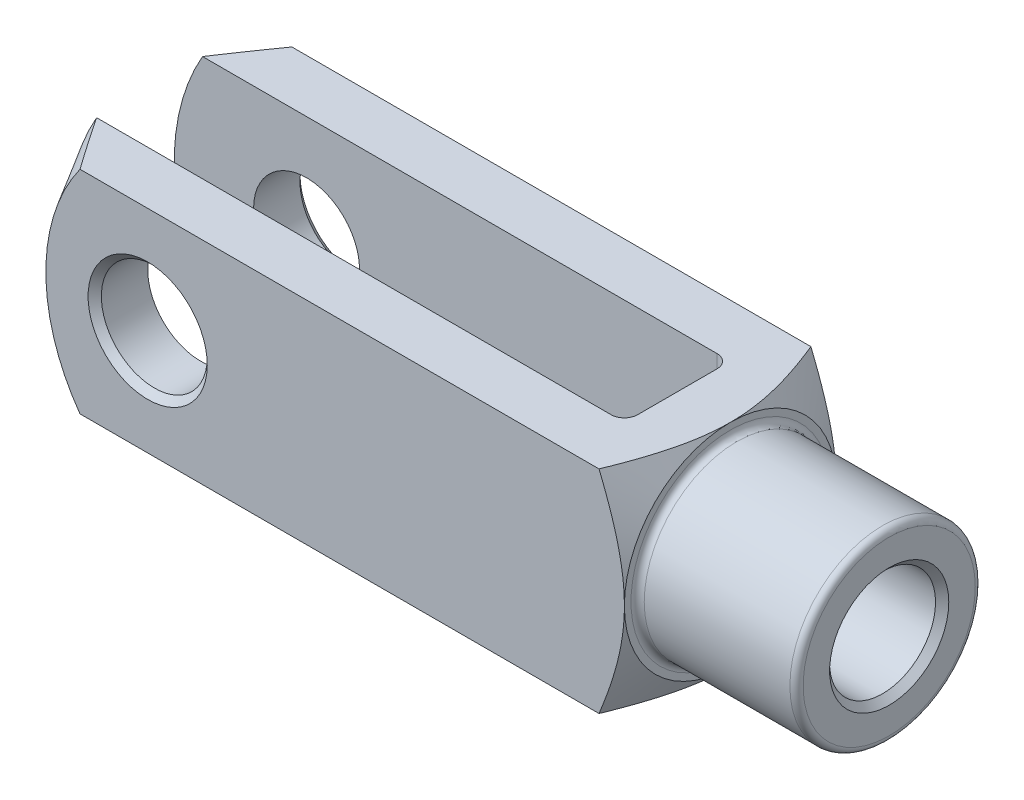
ISO-10303-21;
HEADER;
FILE_DESCRIPTION(('STEP AP214'),'2;1');
FILE_NAME('part.step','',(''),(''),'','','');
FILE_SCHEMA(('AUTOMOTIVE_DESIGN { 1 0 10303 214 1 1 1 1 }'));
ENDSEC;
DATA;
#1=APPLICATION_CONTEXT('core data for automotive mechanical design processes');
#2=APPLICATION_PROTOCOL_DEFINITION('international standard','automotive_design',2000,#1);
#3=PRODUCT_CONTEXT('',#1,'mechanical');
#4=PRODUCT('Part','Part','',(#3));
#5=PRODUCT_RELATED_PRODUCT_CATEGORY('part','',(#4));
#6=PRODUCT_DEFINITION_FORMATION('','',#4);
#7=PRODUCT_DEFINITION_CONTEXT('part definition',#1,'design');
#8=PRODUCT_DEFINITION('design','',#6,#7);
#9=PRODUCT_DEFINITION_SHAPE('','',#8);
#10=(LENGTH_UNIT() NAMED_UNIT(*) SI_UNIT(.MILLI.,.METRE.));
#11=(NAMED_UNIT(*) PLANE_ANGLE_UNIT() SI_UNIT($,.RADIAN.));
#12=(NAMED_UNIT(*) SI_UNIT($,.STERADIAN.) SOLID_ANGLE_UNIT());
#13=UNCERTAINTY_MEASURE_WITH_UNIT(LENGTH_MEASURE(1.E-05),#10,'distance_accuracy_value','');
#14=(GEOMETRIC_REPRESENTATION_CONTEXT(3) GLOBAL_UNCERTAINTY_ASSIGNED_CONTEXT((#13)) GLOBAL_UNIT_ASSIGNED_CONTEXT((#10,
#11,#12)) REPRESENTATION_CONTEXT('',''));
#15=CARTESIAN_POINT('',(0.,0.,0.));
#16=DIRECTION('',(0.,0.,1.));
#17=DIRECTION('',(1.,0.,0.));
#18=AXIS2_PLACEMENT_3D('',#15,#16,#17);
#19=CARTESIAN_POINT('',(-17.,-8.,-2.99999999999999));
#20=DIRECTION('',(0.,-1.,0.));
#21=DIRECTION('',(0.,0.,-1.));
#22=AXIS2_PLACEMENT_3D('',#19,#20,#21);
#23=CYLINDRICAL_SURFACE('',#22,1.);
#24=DIRECTION('',(0.,1.,0.));
#25=VECTOR('',#24,1.);
#26=CARTESIAN_POINT('',(-16.,-8.,-2.99999999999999));
#27=LINE('',#26,#25);
#28=CARTESIAN_POINT('',(-16.,-2.6457513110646,-2.99999999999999));
#29=VERTEX_POINT('',#28);
#30=CARTESIAN_POINT('',(-16.,-8.,-2.99999999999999));
#31=VERTEX_POINT('',#30);
#32=EDGE_CURVE('E358',#29,#31,#27,.F.);
#33=ORIENTED_EDGE('',*,*,#32,.F.);
#34=CARTESIAN_POINT('',(-16.,-2.6457513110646,-2.99999999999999));
#35=CARTESIAN_POINT('',(-16.0000222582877,-2.59691643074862,-3.04308129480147));
#36=CARTESIAN_POINT('',(-16.0027813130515,-2.54706628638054,-3.08491225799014));
#37=CARTESIAN_POINT('',(-16.012996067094,-2.44577843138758,-3.16580783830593));
#38=CARTESIAN_POINT('',(-16.0204427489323,-2.39434394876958,-3.20487760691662));
#39=CARTESIAN_POINT('',(-16.0391856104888,-2.29056221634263,-3.27984708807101));
#40=CARTESIAN_POINT('',(-16.0504501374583,-2.23822572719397,-3.31576990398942));
#41=CARTESIAN_POINT('',(-16.0762500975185,-2.13245420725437,-3.38476417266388));
#42=CARTESIAN_POINT('',(-16.0907876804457,-2.07901847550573,-3.4178337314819));
#43=CARTESIAN_POINT('',(-16.1314716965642,-1.94128133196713,-3.49869690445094));
#44=CARTESIAN_POINT('',(-16.159576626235,-1.85634962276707,-3.54444475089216));
#45=CARTESIAN_POINT('',(-16.2208922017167,-1.68494910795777,-3.62906229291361));
#46=CARTESIAN_POINT('',(-16.2541046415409,-1.5984797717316,-3.66792956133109));
#47=CARTESIAN_POINT('',(-16.3598954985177,-1.33652816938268,-3.77483346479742));
#48=CARTESIAN_POINT('',(-16.4383939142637,-1.15922544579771,-3.83275455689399));
#49=CARTESIAN_POINT('',(-16.5956023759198,-0.820227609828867,-3.91850936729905));
#50=CARTESIAN_POINT('',(-16.6735122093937,-0.658737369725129,-3.94876568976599));
#51=CARTESIAN_POINT('',(-16.8324153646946,-0.335223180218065,-3.98924683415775));
#52=CARTESIAN_POINT('',(-16.9133996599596,-0.17320190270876,-3.99952627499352));
#53=CARTESIAN_POINT('',(-16.9962288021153,-0.0075424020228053,-3.99999466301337));
#54=CARTESIAN_POINT('',(-16.9981144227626,-0.00377116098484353,-3.99999999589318));
#55=CARTESIAN_POINT('',(-17.,0.,-4.));
#56=B_SPLINE_CURVE_WITH_KNOTS('',3,(#34,#35,#36,#37,#38,#39,#40,#41,#42,#43,#44,#45,#46,#47,#48,
#49,#50,#51,#52,#53,#54,#55),.UNSPECIFIED.,.F.,.F.,(4,2,2,2,2,2,2,2,2,2,4),(0.,
0.195194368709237,0.390014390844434,0.583257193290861,0.776627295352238,1.07759313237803,
1.37866492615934,1.98338003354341,2.52784959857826,3.07082842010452,3.08347754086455),.UNSPECIFIED.);
#57=CARTESIAN_POINT('',(-17.,0.,-4.));
#58=VERTEX_POINT('',#57);
#59=EDGE_CURVE('E390',#29,#58,#56,.T.);
#60=ORIENTED_EDGE('',*,*,#59,.T.);
#61=DIRECTION('',(0.,1.,0.));
#62=VECTOR('',#61,1.);
#63=CARTESIAN_POINT('',(-17.,8.,-3.99999999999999));
#64=LINE('',#63,#62);
#65=CARTESIAN_POINT('',(-17.,-8.,-3.99999999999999));
#66=VERTEX_POINT('',#65);
#67=EDGE_CURVE('E183',#66,#58,#64,.T.);
#68=ORIENTED_EDGE('',*,*,#67,.F.);
#69=CARTESIAN_POINT('',(-17.,-8.,-2.99999999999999));
#70=DIRECTION('',(0.,-1.,0.));
#71=DIRECTION('',(0.,0.,-1.));
#72=AXIS2_PLACEMENT_3D('',#69,#70,#71);
#73=CIRCLE('',#72,1.);
#74=EDGE_CURVE('E198',#31,#66,#73,.F.);
#75=ORIENTED_EDGE('',*,*,#74,.F.);
#76=EDGE_LOOP('',(#33,#60,#68,#75));
#77=FACE_BOUND('',#76,.T.);
#78=ADVANCED_FACE('F37',(#77),#23,.F.);
#79=CARTESIAN_POINT('',(-16.,-8.,-3.99999999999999));
#80=DIRECTION('',(1.,0.,0.));
#81=DIRECTION('',(0.,0.,-1.));
#82=AXIS2_PLACEMENT_3D('',#79,#80,#81);
#83=PLANE('',#82);
#84=CARTESIAN_POINT('',(-16.,8.,-2.99999999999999));
#85=VERTEX_POINT('',#84);
#86=CARTESIAN_POINT('',(-16.,2.6457513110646,-2.99999999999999));
#87=VERTEX_POINT('',#86);
#88=EDGE_CURVE('E374',#85,#87,#27,.F.);
#89=ORIENTED_EDGE('',*,*,#88,.T.);
#90=CARTESIAN_POINT('',(-16.,0.,0.));
#91=DIRECTION('',(1.,0.,0.));
#92=DIRECTION('',(0.,0.,-1.));
#93=AXIS2_PLACEMENT_3D('',#90,#91,#92);
#94=CIRCLE('',#93,4.);
#95=CARTESIAN_POINT('',(-16.,2.6457513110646,2.99999999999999));
#96=VERTEX_POINT('',#95);
#97=EDGE_CURVE('E734',#87,#96,#94,.T.);
#98=ORIENTED_EDGE('',*,*,#97,.T.);
#99=DIRECTION('',(0.,1.,0.));
#100=VECTOR('',#99,1.);
#101=CARTESIAN_POINT('',(-16.,8.,2.99999999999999));
#102=LINE('',#101,#100);
#103=CARTESIAN_POINT('',(-16.,8.,2.99999999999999));
#104=VERTEX_POINT('',#103);
#105=EDGE_CURVE('E160',#96,#104,#102,.T.);
#106=ORIENTED_EDGE('',*,*,#105,.T.);
#107=DIRECTION('',(0.,0.,-1.));
#108=VECTOR('',#107,1.);
#109=CARTESIAN_POINT('',(-16.,8.,-3.99999999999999));
#110=LINE('',#109,#108);
#111=EDGE_CURVE('E339',#104,#85,#110,.T.);
#112=ORIENTED_EDGE('',*,*,#111,.T.);
#113=EDGE_LOOP('',(#89,#98,#106,#112));
#114=FACE_BOUND('',#113,.T.);
#115=ADVANCED_FACE('F466',(#114),#83,.F.);
#116=CARTESIAN_POINT('',(-17.,-8.,2.99999999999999));
#117=DIRECTION('',(0.,-1.,0.));
#118=DIRECTION('',(0.,0.,-1.));
#119=AXIS2_PLACEMENT_3D('',#116,#117,#118);
#120=CYLINDRICAL_SURFACE('',#119,1.);
#121=ORIENTED_EDGE('',*,*,#105,.F.);
#122=CARTESIAN_POINT('',(-16.,2.6457513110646,2.99999999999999));
#123=CARTESIAN_POINT('',(-16.0000222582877,2.59691643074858,3.0430812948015));
#124=CARTESIAN_POINT('',(-16.0027813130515,2.54706628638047,3.0849122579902));
#125=CARTESIAN_POINT('',(-16.012996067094,2.44577843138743,3.16580783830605));
#126=CARTESIAN_POINT('',(-16.0204427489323,2.39434394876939,3.20487760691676));
#127=CARTESIAN_POINT('',(-16.0391856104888,2.29056221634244,3.27984708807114));
#128=CARTESIAN_POINT('',(-16.0504501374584,2.23822572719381,3.31576990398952));
#129=CARTESIAN_POINT('',(-16.0762500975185,2.13245420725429,3.38476417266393));
#130=CARTESIAN_POINT('',(-16.0907876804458,2.07901847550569,3.41783373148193));
#131=CARTESIAN_POINT('',(-16.1314716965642,1.94128133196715,3.49869690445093));
#132=CARTESIAN_POINT('',(-16.159576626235,1.85634962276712,3.54444475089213));
#133=CARTESIAN_POINT('',(-16.2208922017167,1.68494910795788,3.62906229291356));
#134=CARTESIAN_POINT('',(-16.2541046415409,1.59847977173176,3.66792956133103));
#135=CARTESIAN_POINT('',(-16.3598954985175,1.33652816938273,3.77483346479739));
#136=CARTESIAN_POINT('',(-16.4383939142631,1.15922544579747,3.83275455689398));
#137=CARTESIAN_POINT('',(-16.5956023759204,0.820227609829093,3.91850936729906));
#138=CARTESIAN_POINT('',(-16.6735122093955,0.658737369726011,3.948765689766));
#139=CARTESIAN_POINT('',(-16.8324153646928,0.335223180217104,3.98924683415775));
#140=CARTESIAN_POINT('',(-16.9133996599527,0.17320190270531,3.99952627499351));
#141=CARTESIAN_POINT('',(-16.996228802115,0.00754240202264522,3.99999466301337));
#142=CARTESIAN_POINT('',(-16.9981144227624,0.0037711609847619,3.99999999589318));
#143=CARTESIAN_POINT('',(-17.,0.,4.));
#144=B_SPLINE_CURVE_WITH_KNOTS('',3,(#122,#123,#124,#125,#126,#127,#128,#129,#130,#131,#132,
#133,#134,#135,#136,#137,#138,#139,#140,#141,#142,#143),.UNSPECIFIED.,.F.,.F.,(4,2,2,2,2,2,2,2,
2,2,4),(0.,0.195194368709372,0.390014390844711,0.583257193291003,0.77662729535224,
1.07759313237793,1.37866492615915,1.98338003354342,2.5278495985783,3.07082842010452,
3.08347754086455),.UNSPECIFIED.);
#145=CARTESIAN_POINT('',(-17.,0.,4.));
#146=VERTEX_POINT('',#145);
#147=EDGE_CURVE('E145',#96,#146,#144,.T.);
#148=ORIENTED_EDGE('',*,*,#147,.T.);
#149=DIRECTION('',(0.,1.,0.));
#150=VECTOR('',#149,1.);
#151=CARTESIAN_POINT('',(-17.,-8.,3.99999999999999));
#152=LINE('',#151,#150);
#153=CARTESIAN_POINT('',(-17.,8.,3.99999999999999));
#154=VERTEX_POINT('',#153);
#155=EDGE_CURVE('E159',#154,#146,#152,.F.);
#156=ORIENTED_EDGE('',*,*,#155,.F.);
#157=CARTESIAN_POINT('',(-17.,8.,2.99999999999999));
#158=DIRECTION('',(0.,1.,0.));
#159=DIRECTION('',(0.,0.,1.));
#160=AXIS2_PLACEMENT_3D('',#157,#158,#159);
#161=CIRCLE('',#160,1.);
#162=EDGE_CURVE('E190',#104,#154,#161,.F.);
#163=ORIENTED_EDGE('',*,*,#162,.F.);
#164=EDGE_LOOP('',(#121,#148,#156,#163));
#165=FACE_BOUND('',#164,.T.);
#166=ADVANCED_FACE('F156',(#165),#120,.F.);
#167=CARTESIAN_POINT('',(-58.,-8.,-3.99999999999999));
#168=DIRECTION('',(0.,0.,-1.));
#169=DIRECTION('',(-1.,0.,0.));
#170=AXIS2_PLACEMENT_3D('',#167,#168,#169);
#171=PLANE('',#170);
#172=CARTESIAN_POINT('',(-48.,0.,-3.99999999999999));
#173=DIRECTION('',(0.,0.,-1.));
#174=DIRECTION('',(-1.,0.,0.));
#175=AXIS2_PLACEMENT_3D('',#172,#173,#174);
#176=CIRCLE('',#175,4.00000000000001);
#177=CARTESIAN_POINT('',(-52.,0.,-3.99999999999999));
#178=VERTEX_POINT('',#177);
#179=EDGE_CURVE('E368',#178,#178,#176,.F.);
#180=ORIENTED_EDGE('',*,*,#179,.F.);
#181=EDGE_LOOP('',(#180));
#182=FACE_BOUND('',#181,.T.);
#183=CARTESIAN_POINT('',(-42.,0.,-3.99999999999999));
#184=DIRECTION('',(0.,0.,1.));
#185=DIRECTION('',(1.,0.,0.));
#186=AXIS2_PLACEMENT_3D('',#183,#184,#185);
#187=CIRCLE('',#186,16.);
#188=CARTESIAN_POINT('',(-55.856406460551,8.,-3.99999999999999));
#189=VERTEX_POINT('',#188);
#190=CARTESIAN_POINT('',(-55.856406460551,-8.,-3.99999999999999));
#191=VERTEX_POINT('',#190);
#192=EDGE_CURVE('E277',#189,#191,#187,.T.);
#193=ORIENTED_EDGE('',*,*,#192,.T.);
#194=DIRECTION('',(-1.,0.,0.));
#195=VECTOR('',#194,1.);
#196=CARTESIAN_POINT('',(-58.,-8.,-3.99999999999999));
#197=LINE('',#196,#195);
#198=EDGE_CURVE('E334',#66,#191,#197,.T.);
#199=ORIENTED_EDGE('',*,*,#198,.F.);
#200=ORIENTED_EDGE('',*,*,#67,.T.);
#201=CARTESIAN_POINT('',(-17.,8.,-3.99999999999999));
#202=VERTEX_POINT('',#201);
#203=EDGE_CURVE('E179',#58,#202,#64,.T.);
#204=ORIENTED_EDGE('',*,*,#203,.T.);
#205=DIRECTION('',(-1.,0.,0.));
#206=VECTOR('',#205,1.);
#207=CARTESIAN_POINT('',(-58.,8.,-3.99999999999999));
#208=LINE('',#207,#206);
#209=EDGE_CURVE('E346',#202,#189,#208,.T.);
#210=ORIENTED_EDGE('',*,*,#209,.T.);
#211=EDGE_LOOP('',(#193,#199,#200,#204,#210));
#212=FACE_BOUND('',#211,.T.);
#213=ADVANCED_FACE('F393',(#182,#212),#171,.F.);
#214=CARTESIAN_POINT('',(-58.,-8.,4.));
#215=DIRECTION('',(0.,0.,1.));
#216=DIRECTION('',(1.,0.,0.));
#217=AXIS2_PLACEMENT_3D('',#214,#215,#216);
#218=PLANE('',#217);
#219=CARTESIAN_POINT('',(-48.,0.,4.));
#220=DIRECTION('',(0.,0.,1.));
#221=DIRECTION('',(1.,0.,0.));
#222=AXIS2_PLACEMENT_3D('',#219,#220,#221);
#223=CIRCLE('',#222,4.00000000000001);
#224=CARTESIAN_POINT('',(-44.,0.,4.));
#225=VERTEX_POINT('',#224);
#226=EDGE_CURVE('E345',#225,#225,#223,.F.);
#227=ORIENTED_EDGE('',*,*,#226,.F.);
#228=EDGE_LOOP('',(#227));
#229=FACE_BOUND('',#228,.T.);
#230=DIRECTION('',(1.,0.,0.));
#231=VECTOR('',#230,1.);
#232=CARTESIAN_POINT('',(-58.,-8.,4.));
#233=LINE('',#232,#231);
#234=CARTESIAN_POINT('',(-55.856406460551,-8.,4.));
#235=VERTEX_POINT('',#234);
#236=CARTESIAN_POINT('',(-17.,-8.,3.99999999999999));
#237=VERTEX_POINT('',#236);
#238=EDGE_CURVE('E338',#235,#237,#233,.T.);
#239=ORIENTED_EDGE('',*,*,#238,.F.);
#240=CARTESIAN_POINT('',(-42.,0.,4.));
#241=DIRECTION('',(0.,0.,1.));
#242=DIRECTION('',(1.,0.,0.));
#243=AXIS2_PLACEMENT_3D('',#240,#241,#242);
#244=CIRCLE('',#243,16.);
#245=CARTESIAN_POINT('',(-55.856406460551,8.,4.));
#246=VERTEX_POINT('',#245);
#247=EDGE_CURVE('E419',#246,#235,#244,.T.);
#248=ORIENTED_EDGE('',*,*,#247,.F.);
#249=DIRECTION('',(1.,0.,0.));
#250=VECTOR('',#249,1.);
#251=CARTESIAN_POINT('',(-58.,8.,4.));
#252=LINE('',#251,#250);
#253=EDGE_CURVE('E176',#246,#154,#252,.T.);
#254=ORIENTED_EDGE('',*,*,#253,.T.);
#255=ORIENTED_EDGE('',*,*,#155,.T.);
#256=EDGE_CURVE('E164',#146,#237,#152,.F.);
#257=ORIENTED_EDGE('',*,*,#256,.T.);
#258=EDGE_LOOP('',(#239,#248,#254,#255,#257));
#259=FACE_BOUND('',#258,.T.);
#260=ADVANCED_FACE('F173',(#229,#259),#218,.F.);
#261=CARTESIAN_POINT('',(-58.,-8.,8.));
#262=DIRECTION('',(0.,0.,1.));
#263=DIRECTION('',(1.,0.,0.));
#264=AXIS2_PLACEMENT_3D('',#261,#262,#263);
#265=PLANE('',#264);
#266=CARTESIAN_POINT('',(-48.,0.,8.));
#267=DIRECTION('',(0.,0.,1.));
#268=DIRECTION('',(1.,0.,0.));
#269=AXIS2_PLACEMENT_3D('',#266,#267,#268);
#270=CIRCLE('',#269,4.50000000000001);
#271=CARTESIAN_POINT('',(-43.5,0.,8.));
#272=VERTEX_POINT('',#271);
#273=EDGE_CURVE('E229',#272,#272,#270,.F.);
#274=ORIENTED_EDGE('',*,*,#273,.T.);
#275=EDGE_LOOP('',(#274));
#276=FACE_BOUND('',#275,.T.);
#277=DIRECTION('',(1.,0.,0.));
#278=VECTOR('',#277,1.);
#279=CARTESIAN_POINT('',(-58.,8.,8.));
#280=LINE('',#279,#278);
#281=CARTESIAN_POINT('',(-53.1100179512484,8.,8.));
#282=VERTEX_POINT('',#281);
#283=CARTESIAN_POINT('',(-13.9131704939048,8.,8.));
#284=VERTEX_POINT('',#283);
#285=EDGE_CURVE('E365',#282,#284,#280,.T.);
#286=ORIENTED_EDGE('',*,*,#285,.F.);
#287=CARTESIAN_POINT('',(-42.,0.,8.));
#288=DIRECTION('',(0.,0.,1.));
#289=DIRECTION('',(1.,0.,0.));
#290=AXIS2_PLACEMENT_3D('',#287,#288,#289);
#291=CIRCLE('',#290,13.6905989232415);
#292=CARTESIAN_POINT('',(-53.1100179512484,-8.,8.));
#293=VERTEX_POINT('',#292);
#294=EDGE_CURVE('E61',#282,#293,#291,.T.);
#295=ORIENTED_EDGE('',*,*,#294,.T.);
#296=DIRECTION('',(1.,0.,0.));
#297=VECTOR('',#296,1.);
#298=CARTESIAN_POINT('',(-58.,-8.,8.));
#299=LINE('',#298,#297);
#300=CARTESIAN_POINT('',(-13.9131704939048,-8.,8.));
#301=VERTEX_POINT('',#300);
#302=EDGE_CURVE('E362',#293,#301,#299,.T.);
#303=ORIENTED_EDGE('',*,*,#302,.T.);
#304=CARTESIAN_POINT('',(-17.8846987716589,-16.3392348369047,8.));
#305=CARTESIAN_POINT('',(-17.6802772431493,-15.9449469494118,8.));
#306=CARTESIAN_POINT('',(-17.4769364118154,-15.5500935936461,8.));
#307=CARTESIAN_POINT('',(-17.0729892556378,-14.7589649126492,8.));
#308=CARTESIAN_POINT('',(-16.8723830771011,-14.3626895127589,8.));
#309=CARTESIAN_POINT('',(-16.474153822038,-13.56777616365,8.));
#310=CARTESIAN_POINT('',(-16.2765365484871,-13.1691353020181,8.));
#311=CARTESIAN_POINT('',(-15.88546114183,-12.3698241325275,8.));
#312=CARTESIAN_POINT('',(-15.6920029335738,-11.9691538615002,8.));
#313=CARTESIAN_POINT('',(-15.2985635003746,-11.1406012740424,8.));
#314=CARTESIAN_POINT('',(-15.0989132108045,-10.7125613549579,8.));
#315=CARTESIAN_POINT('',(-14.7072115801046,-9.85297670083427,8.));
#316=CARTESIAN_POINT('',(-14.5151606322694,-9.42143178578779,8.));
#317=CARTESIAN_POINT('',(-14.1411578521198,-8.55419814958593,8.));
#318=CARTESIAN_POINT('',(-13.959201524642,-8.1185113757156,8.));
#319=CARTESIAN_POINT('',(-13.6086480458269,-7.24179288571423,8.));
#320=CARTESIAN_POINT('',(-13.4400493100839,-6.80076181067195,8.));
#321=CARTESIAN_POINT('',(-13.1834024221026,-6.08615976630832,8.));
#322=CARTESIAN_POINT('',(-13.0896630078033,-5.81463561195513,8.));
#323=CARTESIAN_POINT('',(-12.9102546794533,-5.2689424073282,8.));
#324=CARTESIAN_POINT('',(-12.8245850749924,-4.99477358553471,8.));
#325=CARTESIAN_POINT('',(-12.6629013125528,-4.44359021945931,8.));
#326=CARTESIAN_POINT('',(-12.5868869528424,-4.16657573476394,8.));
#327=CARTESIAN_POINT('',(-12.4463305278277,-3.60962774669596,8.));
#328=CARTESIAN_POINT('',(-12.3817883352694,-3.32969427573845,8.));
#329=CARTESIAN_POINT('',(-12.267479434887,-2.77364565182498,8.));
#330=CARTESIAN_POINT('',(-12.2174014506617,-2.49759512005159,8.));
#331=CARTESIAN_POINT('',(-12.1318063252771,-1.94322662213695,8.));
#332=CARTESIAN_POINT('',(-12.0962887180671,-1.66490872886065,8.));
#333=CARTESIAN_POINT('',(-12.0412989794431,-1.10685523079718,8.));
#334=CARTESIAN_POINT('',(-12.0218163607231,-0.827120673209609,8.));
#335=CARTESIAN_POINT('',(-11.9997560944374,-0.266983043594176,8.));
#336=CARTESIAN_POINT('',(-11.9971778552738,0.0134200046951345,8.));
#337=CARTESIAN_POINT('',(-12.0086102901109,0.55343206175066,8.));
#338=CARTESIAN_POINT('',(-12.0214258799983,0.813067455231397,8.));
#339=CARTESIAN_POINT('',(-12.0611642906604,1.3312448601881,8.));
#340=CARTESIAN_POINT('',(-12.0880870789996,1.5897868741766,8.));
#341=CARTESIAN_POINT('',(-12.155052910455,2.10528244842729,8.));
#342=CARTESIAN_POINT('',(-12.195102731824,2.36223511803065,8.));
#343=CARTESIAN_POINT('',(-12.2870021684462,2.87400792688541,8.));
#344=CARTESIAN_POINT('',(-12.3388521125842,3.12882800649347,8.));
#345=CARTESIAN_POINT('',(-12.4545600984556,3.6434629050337,8.));
#346=CARTESIAN_POINT('',(-12.518722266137,3.90320881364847,8.));
#347=CARTESIAN_POINT('',(-12.6564654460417,4.42017468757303,8.));
#348=CARTESIAN_POINT('',(-12.7300465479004,4.67739462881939,8.));
#349=CARTESIAN_POINT('',(-12.8852035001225,5.18938513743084,8.));
#350=CARTESIAN_POINT('',(-12.9667789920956,5.44415581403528,8.));
#351=CARTESIAN_POINT('',(-13.1366771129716,5.95141147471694,8.));
#352=CARTESIAN_POINT('',(-13.224999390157,6.20389657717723,8.));
#353=CARTESIAN_POINT('',(-13.4147611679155,6.7272922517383,8.));
#354=CARTESIAN_POINT('',(-13.5166830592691,6.99802735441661,8.));
#355=CARTESIAN_POINT('',(-13.7260618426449,7.53735530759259,8.));
#356=CARTESIAN_POINT('',(-13.8335190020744,7.80594805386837,8.));
#357=CARTESIAN_POINT('',(-14.0530704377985,8.3412927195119,8.));
#358=CARTESIAN_POINT('',(-14.1651656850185,8.60804423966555,8.));
#359=CARTESIAN_POINT('',(-14.3932328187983,9.13988748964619,8.));
#360=CARTESIAN_POINT('',(-14.5092047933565,9.40497918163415,8.));
#361=CARTESIAN_POINT('',(-14.8621889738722,10.1985259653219,8.));
#362=CARTESIAN_POINT('',(-15.1040848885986,10.7248088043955,8.));
#363=CARTESIAN_POINT('',(-15.5972155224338,11.7728810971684,8.));
#364=CARTESIAN_POINT('',(-15.8484492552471,12.2946710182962,8.));
#365=CARTESIAN_POINT('',(-16.3586491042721,13.3364224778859,8.));
#366=CARTESIAN_POINT('',(-16.6176364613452,13.8563735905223,8.));
#367=CARTESIAN_POINT('',(-17.1409123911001,14.8936090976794,8.));
#368=CARTESIAN_POINT('',(-17.4052010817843,15.4108934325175,8.));
#369=CARTESIAN_POINT('',(-17.9377393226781,16.4430931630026,8.));
#370=CARTESIAN_POINT('',(-18.2059868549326,16.9580096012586,8.));
#371=CARTESIAN_POINT('',(-18.7457004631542,17.9861456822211,8.));
#372=CARTESIAN_POINT('',(-19.0171665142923,18.4993653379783,8.));
#373=CARTESIAN_POINT('',(-19.754394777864,19.8847467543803,8.));
#374=CARTESIAN_POINT('',(-20.2225895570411,20.7556134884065,8.));
#375=CARTESIAN_POINT('',(-21.164259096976,22.494640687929,8.));
#376=CARTESIAN_POINT('',(-21.6377345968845,23.3628007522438,8.));
#377=CARTESIAN_POINT('',(-22.5857843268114,25.0920581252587,8.));
#378=CARTESIAN_POINT('',(-23.0603367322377,25.9531674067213,8.));
#379=CARTESIAN_POINT('',(-23.7742624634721,27.2435811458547,8.));
#380=CARTESIAN_POINT('',(-24.0125683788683,27.6734768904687,8.));
#381=CARTESIAN_POINT('',(-24.4898082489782,28.5329190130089,8.));
#382=CARTESIAN_POINT('',(-24.7287422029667,28.9624653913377,8.));
#383=CARTESIAN_POINT('',(-24.9679488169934,29.3918599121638,8.));
#384=B_SPLINE_CURVE_WITH_KNOTS('',3,(#304,#305,#306,#307,#308,#309,#310,#311,#312,#313,#314,
#315,#316,#317,#318,#319,#320,#321,#322,#323,#324,#325,#326,#327,#328,#329,#330,#331,#332,#333,
#334,#335,#336,#337,#338,#339,#340,#341,#342,#343,#344,#345,#346,#347,#348,#349,#350,#351,#352,
#353,#354,#355,#356,#357,#358,#359,#360,#361,#362,#363,#364,#365,#366,#367,#368,#369,#370,#371,
#372,#373,#374,#375,#376,#377,#378,#379,#380,#381,#382,#383),.UNSPECIFIED.,.F.,.F.,(4,2,2,2,2,2,
2,2,2,2,2,2,2,2,2,2,2,2,2,2,2,2,2,2,2,2,2,2,2,2,2,2,2,2,2,2,2,2,2,4),(0.,1.33239397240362,
2.66485895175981,3.99964423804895,5.33440538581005,6.7512847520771,8.16823735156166,
9.58455382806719,11.0007020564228,11.8623516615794,12.7239274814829,13.5854852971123,
14.4470335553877,15.2883577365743,16.1296549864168,16.9704015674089,17.8111187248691,
18.590575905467,19.3700312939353,20.149889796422,20.9297700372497,21.732223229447,
22.5346840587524,23.3371089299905,24.139491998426,25.0072719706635,25.8750939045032,
26.7430984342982,27.6111226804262,29.3486130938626,31.085920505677,32.8285250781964,
34.5711684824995,36.312952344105,38.0547227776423,41.0209268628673,43.9875514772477,
46.9371849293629,48.4117694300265,49.8863522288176),.UNSPECIFIED.);
#385=CARTESIAN_POINT('',(-12.,0.,8.));
#386=VERTEX_POINT('',#385);
#387=EDGE_CURVE('E306',#386,#301,#384,.F.);
#388=ORIENTED_EDGE('',*,*,#387,.F.);
#389=EDGE_CURVE('E304',#284,#386,#384,.F.);
#390=ORIENTED_EDGE('',*,*,#389,.F.);
#391=EDGE_LOOP('',(#286,#295,#303,#388,#390));
#392=FACE_BOUND('',#391,.T.);
#393=ADVANCED_FACE('F288',(#276,#392),#265,.T.);
#394=CARTESIAN_POINT('',(-58.,-8.,8.));
#395=DIRECTION('',(0.,-1.,0.));
#396=DIRECTION('',(0.,0.,-1.));
#397=AXIS2_PLACEMENT_3D('',#394,#395,#396);
#398=PLANE('',#397);
#399=ORIENTED_EDGE('',*,*,#198,.T.);
#400=CARTESIAN_POINT('',(-62.1857767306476,-8.,5.89565350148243));
#401=CARTESIAN_POINT('',(-61.7965292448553,-8.,5.26892979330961));
#402=CARTESIAN_POINT('',(-61.4062157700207,-8.,4.64286516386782));
#403=CARTESIAN_POINT('',(-60.6229580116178,-8.,3.39236663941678));
#404=CARTESIAN_POINT('',(-60.230013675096,-8.,2.76793277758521));
#405=CARTESIAN_POINT('',(-59.4405400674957,-8.,1.52028939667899));
#406=CARTESIAN_POINT('',(-59.0440070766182,-8.,0.897082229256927));
#407=CARTESIAN_POINT('',(-58.2471530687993,-8.,-0.34689989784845));
#408=CARTESIAN_POINT('',(-57.8468320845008,-8.,-0.967674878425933));
#409=CARTESIAN_POINT('',(-57.0247666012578,-8.,-2.23198790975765));
#410=CARTESIAN_POINT('',(-56.6028241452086,-8.,-2.87539744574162));
#411=CARTESIAN_POINT('',(-55.7525673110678,-8.,-4.15798891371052));
#412=CARTESIAN_POINT('',(-55.3242529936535,-8.,-4.79717088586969));
#413=CARTESIAN_POINT('',(-54.459739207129,-8.,-6.06950936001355));
#414=CARTESIAN_POINT('',(-54.0235458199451,-8.,-6.70266997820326));
#415=CARTESIAN_POINT('',(-53.3611233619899,-8.,-7.64668569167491));
#416=CARTESIAN_POINT('',(-53.138964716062,-8.,-7.96039757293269));
#417=CARTESIAN_POINT('',(-52.6914753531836,-8.,-8.58554886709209));
#418=CARTESIAN_POINT('',(-52.4661446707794,-8.,-8.8969883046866));
#419=CARTESIAN_POINT('',(-52.0138777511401,-8.,-9.51426261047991));
#420=CARTESIAN_POINT('',(-51.7869759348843,-8.,-9.82012266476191));
#421=CARTESIAN_POINT('',(-51.3288611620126,-8.,-10.4285917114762));
#422=CARTESIAN_POINT('',(-51.0976483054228,-8.,-10.7312007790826));
#423=CARTESIAN_POINT('',(-50.6297403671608,-8.,-11.3328374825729));
#424=CARTESIAN_POINT('',(-50.3930380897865,-8.,-11.6318595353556));
#425=CARTESIAN_POINT('',(-49.9133962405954,-8.,-12.224846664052));
#426=CARTESIAN_POINT('',(-49.6704570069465,-8.,-12.518812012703));
#427=CARTESIAN_POINT('',(-49.1794855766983,-8.,-13.0972598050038));
#428=CARTESIAN_POINT('',(-48.9315323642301,-8.,-13.3818089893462));
#429=CARTESIAN_POINT('',(-48.4262856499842,-8.,-13.9426547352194));
#430=CARTESIAN_POINT('',(-48.1689897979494,-8.,-14.2189491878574));
#431=CARTESIAN_POINT('',(-47.6433260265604,-8.,-14.7597258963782));
#432=CARTESIAN_POINT('',(-47.374984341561,-8.,-15.024233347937));
#433=CARTESIAN_POINT('',(-46.9615433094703,-8.,-15.4091163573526));
#434=CARTESIAN_POINT('',(-46.8219428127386,-8.,-15.5354022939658));
#435=CARTESIAN_POINT('',(-46.5385996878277,-8.,-15.7832263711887));
#436=CARTESIAN_POINT('',(-46.3948575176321,-8.,-15.9047650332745));
#437=CARTESIAN_POINT('',(-46.0975226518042,-8.,-16.1463249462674));
#438=CARTESIAN_POINT('',(-45.9437613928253,-8.,-16.266139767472));
#439=CARTESIAN_POINT('',(-45.6305832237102,-8.,-16.4982387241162));
#440=CARTESIAN_POINT('',(-45.4711652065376,-8.,-16.6105213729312));
#441=CARTESIAN_POINT('',(-45.1461892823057,-8.,-16.8256372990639));
#442=CARTESIAN_POINT('',(-44.9806363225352,-8.,-16.9284779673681));
#443=CARTESIAN_POINT('',(-44.6428904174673,-8.,-17.1224621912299));
#444=CARTESIAN_POINT('',(-44.4706992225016,-8.,-17.213608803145));
#445=CARTESIAN_POINT('',(-44.0236575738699,-8.,-17.4270731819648));
#446=CARTESIAN_POINT('',(-43.7438013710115,-8.,-17.5394682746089));
#447=CARTESIAN_POINT('',(-43.3134448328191,-8.,-17.6730277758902));
#448=CARTESIAN_POINT('',(-43.1682897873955,-8.,-17.7117004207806));
#449=CARTESIAN_POINT('',(-42.8750748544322,-8.,-17.7760297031));
#450=CARTESIAN_POINT('',(-42.7270150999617,-8.,-17.801686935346));
#451=CARTESIAN_POINT('',(-42.427625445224,-8.,-17.8390585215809));
#452=CARTESIAN_POINT('',(-42.2762776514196,-8.,-17.8506309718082));
#453=CARTESIAN_POINT('',(-41.9731780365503,-8.,-17.8588139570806));
#454=CARTESIAN_POINT('',(-41.8214262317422,-8.,-17.855425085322));
#455=CARTESIAN_POINT('',(-41.518960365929,-8.,-17.8338479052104));
#456=CARTESIAN_POINT('',(-41.3682465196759,-8.,-17.8156566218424));
#457=CARTESIAN_POINT('',(-41.0691796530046,-8.,-17.765312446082));
#458=CARTESIAN_POINT('',(-40.9208270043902,-8.,-17.7331573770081));
#459=CARTESIAN_POINT('',(-40.6002883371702,-8.,-17.6490655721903));
#460=CARTESIAN_POINT('',(-40.4287768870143,-8.,-17.5945681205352));
#461=CARTESIAN_POINT('',(-40.0913326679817,-8.,-17.47036463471));
#462=CARTESIAN_POINT('',(-39.9254030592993,-8.,-17.400650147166));
#463=CARTESIAN_POINT('',(-39.5990125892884,-8.,-17.2483781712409));
#464=CARTESIAN_POINT('',(-39.4385691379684,-8.,-17.1657837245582));
#465=CARTESIAN_POINT('',(-39.1235514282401,-8.,-16.9902060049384));
#466=CARTESIAN_POINT('',(-38.9689765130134,-8.,-16.897223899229));
#467=CARTESIAN_POINT('',(-38.6154702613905,-8.,-16.6708821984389));
#468=CARTESIAN_POINT('',(-38.4186208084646,-8.,-16.534282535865));
#469=CARTESIAN_POINT('',(-38.0333734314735,-8.,-16.2495879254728));
#470=CARTESIAN_POINT('',(-37.8449795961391,-8.,-16.1014875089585));
#471=CARTESIAN_POINT('',(-37.4752188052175,-8.,-15.7961052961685));
#472=CARTESIAN_POINT('',(-37.2938660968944,-8.,-15.6388063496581));
#473=CARTESIAN_POINT('',(-36.9375595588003,-8.,-15.3172162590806));
#474=CARTESIAN_POINT('',(-36.7626046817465,-8.,-15.1529262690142));
#475=CARTESIAN_POINT('',(-36.4170062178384,-8.,-14.8176183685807));
#476=CARTESIAN_POINT('',(-36.2463993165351,-8.,-14.6465627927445));
#477=CARTESIAN_POINT('',(-35.9099413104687,-8.,-14.299840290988));
#478=CARTESIAN_POINT('',(-35.7440903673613,-8.,-14.1241732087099));
#479=CARTESIAN_POINT('',(-35.4166747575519,-8.,-13.7692439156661));
#480=CARTESIAN_POINT('',(-35.2551057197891,-8.,-13.5899857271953));
#481=CARTESIAN_POINT('',(-34.9355274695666,-8.,-13.2283206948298));
#482=CARTESIAN_POINT('',(-34.7775183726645,-8.,-13.0459137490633));
#483=CARTESIAN_POINT('',(-34.3998299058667,-8.,-12.6023889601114));
#484=CARTESIAN_POINT('',(-34.1817025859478,-8.,-12.3399501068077));
#485=CARTESIAN_POINT('',(-33.7505813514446,-8.,-11.8108173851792));
#486=CARTESIAN_POINT('',(-33.5375884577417,-8.,-11.5441226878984));
#487=CARTESIAN_POINT('',(-33.1191841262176,-8.,-11.0114334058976));
#488=CARTESIAN_POINT('',(-32.9137065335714,-8.,-10.7454906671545));
#489=CARTESIAN_POINT('',(-32.506432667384,-8.,-10.2109265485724));
#490=CARTESIAN_POINT('',(-32.3046352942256,-8.,-9.9423060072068));
#491=CARTESIAN_POINT('',(-32.1043464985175,-8.,-9.67257983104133));
#492=B_SPLINE_CURVE_WITH_KNOTS('',3,(#400,#401,#402,#403,#404,#405,#406,#407,#408,#409,#410,
#411,#412,#413,#414,#415,#416,#417,#418,#419,#420,#421,#422,#423,#424,#425,#426,#427,#428,#429,
#430,#431,#432,#433,#434,#435,#436,#437,#438,#439,#440,#441,#442,#443,#444,#445,#446,#447,#448,
#449,#450,#451,#452,#453,#454,#455,#456,#457,#458,#459,#460,#461,#462,#463,#464,#465,#466,#467,
#468,#469,#470,#471,#472,#473,#474,#475,#476,#477,#478,#479,#480,#481,#482,#483,#484,#485,#486,
#487,#488,#489,#490,#491),.UNSPECIFIED.,.F.,.F.,(4,2,2,2,2,2,2,2,2,2,2,2,2,2,2,2,2,2,2,2,2,2,2,
2,2,2,2,2,2,2,2,2,2,2,2,2,2,2,2,2,2,2,2,2,2,4),(0.,2.21329571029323,4.42663610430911,
6.64261887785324,8.85858257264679,11.1668200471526,13.4750355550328,15.7815396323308,
16.9347484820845,18.0879447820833,19.2304162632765,20.3728612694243,21.5168995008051,
22.6608758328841,23.7929840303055,24.9253790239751,26.055224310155,26.6198776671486,
27.1844688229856,27.7690691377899,28.3537844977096,28.9380381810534,29.5221388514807,
30.4231831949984,30.8733513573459,31.3234989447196,31.7781451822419,32.2327733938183,
32.6874929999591,33.1422835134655,33.6813034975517,34.220623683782,34.7615209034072,
35.302357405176,36.0205977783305,36.7391817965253,37.4591511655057,38.1790021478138,
38.9036703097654,39.6283630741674,40.3522850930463,41.0762305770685,42.0999043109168,
43.1237799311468,44.1319728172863,45.1398593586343),.UNSPECIFIED.);
#493=CARTESIAN_POINT('',(-53.1100179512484,-8.,-8.));
#494=VERTEX_POINT('',#493);
#495=EDGE_CURVE('E276',#191,#494,#492,.T.);
#496=ORIENTED_EDGE('',*,*,#495,.T.);
#497=DIRECTION('',(1.,0.,0.));
#498=VECTOR('',#497,1.);
#499=CARTESIAN_POINT('',(-58.,-8.,-8.));
#500=LINE('',#499,#498);
#501=CARTESIAN_POINT('',(-13.9131704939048,-8.,-8.));
#502=VERTEX_POINT('',#501);
#503=EDGE_CURVE('E359',#494,#502,#500,.T.);
#504=ORIENTED_EDGE('',*,*,#503,.T.);
#505=CARTESIAN_POINT('',(-17.8846987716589,-8.,-16.3392348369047));
#506=CARTESIAN_POINT('',(-17.6802772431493,-8.,-15.9449469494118));
#507=CARTESIAN_POINT('',(-17.4769364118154,-8.,-15.550093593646));
#508=CARTESIAN_POINT('',(-17.0729892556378,-8.,-14.7589649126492));
#509=CARTESIAN_POINT('',(-16.8723830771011,-8.,-14.3626895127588));
#510=CARTESIAN_POINT('',(-16.474153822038,-8.,-13.56777616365));
#511=CARTESIAN_POINT('',(-16.2765365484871,-8.,-13.1691353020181));
#512=CARTESIAN_POINT('',(-15.88546114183,-8.,-12.3698241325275));
#513=CARTESIAN_POINT('',(-15.6920029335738,-8.,-11.9691538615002));
#514=CARTESIAN_POINT('',(-15.2985635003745,-8.,-11.1406012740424));
#515=CARTESIAN_POINT('',(-15.0989132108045,-8.,-10.7125613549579));
#516=CARTESIAN_POINT('',(-14.7072115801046,-8.,-9.85297670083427));
#517=CARTESIAN_POINT('',(-14.5151606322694,-8.,-9.42143178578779));
#518=CARTESIAN_POINT('',(-14.1411578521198,-8.,-8.55419814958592));
#519=CARTESIAN_POINT('',(-13.959201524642,-8.,-8.11851137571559));
#520=CARTESIAN_POINT('',(-13.6086480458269,-8.,-7.24179288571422));
#521=CARTESIAN_POINT('',(-13.4400493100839,-8.,-6.80076181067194));
#522=CARTESIAN_POINT('',(-13.1834024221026,-8.,-6.08615976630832));
#523=CARTESIAN_POINT('',(-13.0896630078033,-8.,-5.81463561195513));
#524=CARTESIAN_POINT('',(-12.9102546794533,-8.,-5.2689424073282));
#525=CARTESIAN_POINT('',(-12.8245850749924,-8.,-4.99477358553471));
#526=CARTESIAN_POINT('',(-12.6629013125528,-8.,-4.44359021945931));
#527=CARTESIAN_POINT('',(-12.5868869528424,-8.,-4.16657573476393));
#528=CARTESIAN_POINT('',(-12.4463305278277,-8.,-3.60962774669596));
#529=CARTESIAN_POINT('',(-12.3817883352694,-8.,-3.32969427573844));
#530=CARTESIAN_POINT('',(-12.267479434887,-8.,-2.77364565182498));
#531=CARTESIAN_POINT('',(-12.2174014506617,-8.,-2.49759512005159));
#532=CARTESIAN_POINT('',(-12.1318063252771,-8.,-1.94322662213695));
#533=CARTESIAN_POINT('',(-12.0962887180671,-8.,-1.66490872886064));
#534=CARTESIAN_POINT('',(-12.0412989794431,-8.,-1.10685523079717));
#535=CARTESIAN_POINT('',(-12.0218163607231,-8.,-0.827120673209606));
#536=CARTESIAN_POINT('',(-11.9997560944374,-8.,-0.266983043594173));
#537=CARTESIAN_POINT('',(-11.9971778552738,-8.,0.0134200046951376));
#538=CARTESIAN_POINT('',(-12.0086102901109,-8.,0.553432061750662));
#539=CARTESIAN_POINT('',(-12.0214258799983,-8.,0.813067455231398));
#540=CARTESIAN_POINT('',(-12.0611642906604,-8.,1.3312448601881));
#541=CARTESIAN_POINT('',(-12.0880870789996,-8.,1.58978687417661));
#542=CARTESIAN_POINT('',(-12.155052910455,-8.,2.10528244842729));
#543=CARTESIAN_POINT('',(-12.195102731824,-8.,2.36223511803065));
#544=CARTESIAN_POINT('',(-12.2870021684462,-8.,2.87400792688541));
#545=CARTESIAN_POINT('',(-12.3388521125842,-8.,3.12882800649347));
#546=CARTESIAN_POINT('',(-12.4545600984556,-8.,3.64346290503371));
#547=CARTESIAN_POINT('',(-12.518722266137,-8.,3.90320881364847));
#548=CARTESIAN_POINT('',(-12.6564654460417,-8.,4.42017468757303));
#549=CARTESIAN_POINT('',(-12.7300465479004,-8.,4.67739462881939));
#550=CARTESIAN_POINT('',(-12.8852035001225,-8.,5.18938513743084));
#551=CARTESIAN_POINT('',(-12.9667789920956,-8.,5.44415581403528));
#552=CARTESIAN_POINT('',(-13.1366771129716,-8.,5.95141147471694));
#553=CARTESIAN_POINT('',(-13.224999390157,-8.,6.20389657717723));
#554=CARTESIAN_POINT('',(-13.4147611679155,-8.,6.7272922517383));
#555=CARTESIAN_POINT('',(-13.5166830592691,-8.,6.99802735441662));
#556=CARTESIAN_POINT('',(-13.7260618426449,-8.,7.5373553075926));
#557=CARTESIAN_POINT('',(-13.8335190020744,-8.,7.80594805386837));
#558=CARTESIAN_POINT('',(-14.0530704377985,-8.,8.3412927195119));
#559=CARTESIAN_POINT('',(-14.1651656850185,-8.,8.60804423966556));
#560=CARTESIAN_POINT('',(-14.3932328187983,-8.,9.13988748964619));
#561=CARTESIAN_POINT('',(-14.5092047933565,-8.,9.40497918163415));
#562=CARTESIAN_POINT('',(-14.8621889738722,-8.,10.1985259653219));
#563=CARTESIAN_POINT('',(-15.1040848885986,-8.,10.7248088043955));
#564=CARTESIAN_POINT('',(-15.5972155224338,-8.,11.7728810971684));
#565=CARTESIAN_POINT('',(-15.8484492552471,-8.,12.2946710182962));
#566=CARTESIAN_POINT('',(-16.3586491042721,-8.,13.3364224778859));
#567=CARTESIAN_POINT('',(-16.6176364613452,-8.,13.8563735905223));
#568=CARTESIAN_POINT('',(-17.1409123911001,-8.,14.8936090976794));
#569=CARTESIAN_POINT('',(-17.4052010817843,-8.,15.4108934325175));
#570=CARTESIAN_POINT('',(-17.9377393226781,-8.,16.4430931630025));
#571=CARTESIAN_POINT('',(-18.2059868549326,-8.,16.9580096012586));
#572=CARTESIAN_POINT('',(-18.7457004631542,-8.,17.9861456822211));
#573=CARTESIAN_POINT('',(-19.0171665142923,-8.,18.4993653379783));
#574=CARTESIAN_POINT('',(-19.754394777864,-8.,19.8847467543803));
#575=CARTESIAN_POINT('',(-20.2225895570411,-8.,20.7556134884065));
#576=CARTESIAN_POINT('',(-21.164259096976,-8.,22.494640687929));
#577=CARTESIAN_POINT('',(-21.6377345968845,-8.,23.3628007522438));
#578=CARTESIAN_POINT('',(-22.5857843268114,-8.,25.0920581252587));
#579=CARTESIAN_POINT('',(-23.0603367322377,-8.,25.9531674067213));
#580=CARTESIAN_POINT('',(-23.7742624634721,-8.,27.2435811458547));
#581=CARTESIAN_POINT('',(-24.0125683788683,-8.,27.6734768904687));
#582=CARTESIAN_POINT('',(-24.4898082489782,-8.,28.5329190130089));
#583=CARTESIAN_POINT('',(-24.7287422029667,-8.,28.9624653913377));
#584=CARTESIAN_POINT('',(-24.9679488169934,-8.,29.3918599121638));
#585=B_SPLINE_CURVE_WITH_KNOTS('',3,(#505,#506,#507,#508,#509,#510,#511,#512,#513,#514,#515,
#516,#517,#518,#519,#520,#521,#522,#523,#524,#525,#526,#527,#528,#529,#530,#531,#532,#533,#534,
#535,#536,#537,#538,#539,#540,#541,#542,#543,#544,#545,#546,#547,#548,#549,#550,#551,#552,#553,
#554,#555,#556,#557,#558,#559,#560,#561,#562,#563,#564,#565,#566,#567,#568,#569,#570,#571,#572,
#573,#574,#575,#576,#577,#578,#579,#580,#581,#582,#583,#584),.UNSPECIFIED.,.F.,.F.,(4,2,2,2,2,2,
2,2,2,2,2,2,2,2,2,2,2,2,2,2,2,2,2,2,2,2,2,2,2,2,2,2,2,2,2,2,2,2,2,4),(0.,1.33239397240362,
2.66485895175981,3.99964423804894,5.33440538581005,6.7512847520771,8.16823735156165,
9.58455382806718,11.0007020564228,11.8623516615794,12.7239274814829,13.5854852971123,
14.4470335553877,15.2883577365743,16.1296549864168,16.9704015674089,17.8111187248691,
18.590575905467,19.3700312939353,20.1498897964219,20.9297700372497,21.732223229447,
22.5346840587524,23.3371089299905,24.139491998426,25.0072719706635,25.8750939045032,
26.7430984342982,27.6111226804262,29.3486130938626,31.085920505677,32.8285250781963,
34.5711684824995,36.3129523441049,38.0547227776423,41.0209268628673,43.9875514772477,
46.9371849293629,48.4117694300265,49.8863522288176),.UNSPECIFIED.);
#586=CARTESIAN_POINT('',(-12.,-8.,0.));
#587=VERTEX_POINT('',#586);
#588=EDGE_CURVE('E305',#587,#502,#585,.F.);
#589=ORIENTED_EDGE('',*,*,#588,.F.);
#590=EDGE_CURVE('E296',#301,#587,#585,.F.);
#591=ORIENTED_EDGE('',*,*,#590,.F.);
#592=ORIENTED_EDGE('',*,*,#302,.F.);
#593=CARTESIAN_POINT('',(-32.1043464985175,-8.,9.67257983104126));
#594=CARTESIAN_POINT('',(-32.2670589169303,-8.,9.89172310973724));
#595=CARTESIAN_POINT('',(-32.4307769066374,-8.,10.1101254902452));
#596=CARTESIAN_POINT('',(-32.7605411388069,-8.,10.5451887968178));
#597=CARTESIAN_POINT('',(-32.9265875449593,-8.,10.7618495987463));
#598=CARTESIAN_POINT('',(-33.2615996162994,-8.,11.193521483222));
#599=CARTESIAN_POINT('',(-33.4305699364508,-8.,11.408528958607));
#600=CARTESIAN_POINT('',(-33.7715201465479,-8.,11.8361395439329));
#601=CARTESIAN_POINT('',(-33.943499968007,-8.,12.0487427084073));
#602=CARTESIAN_POINT('',(-34.2926381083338,-8.,12.4731812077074));
#603=CARTESIAN_POINT('',(-34.4698307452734,-8.,12.6849883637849));
#604=CARTESIAN_POINT('',(-34.8283156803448,-8.,13.1051024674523));
#605=CARTESIAN_POINT('',(-35.009607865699,-8.,13.3134095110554));
#606=CARTESIAN_POINT('',(-35.3768683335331,-8.,13.7256241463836));
#607=CARTESIAN_POINT('',(-35.5628334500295,-8.,13.9295345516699));
#608=CARTESIAN_POINT('',(-35.9403853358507,-8.,14.3320667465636));
#609=CARTESIAN_POINT('',(-36.1319715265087,-8.,14.5306890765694));
#610=CARTESIAN_POINT('',(-36.4910790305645,-8.,14.8904806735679));
#611=CARTESIAN_POINT('',(-36.6576300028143,-8.,15.0526161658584));
#612=CARTESIAN_POINT('',(-36.9962433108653,-8.,15.371085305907));
#613=CARTESIAN_POINT('',(-37.1683061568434,-8.,15.5274184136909));
#614=CARTESIAN_POINT('',(-37.5189019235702,-8.,15.8328947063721));
#615=CARTESIAN_POINT('',(-37.6974384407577,-8.,15.9820337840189));
#616=CARTESIAN_POINT('',(-38.0618750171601,-8.,16.2710601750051));
#617=CARTESIAN_POINT('',(-38.2477741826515,-8.,16.4109486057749));
#618=CARTESIAN_POINT('',(-38.6012192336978,-8.,16.6599597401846));
#619=CARTESIAN_POINT('',(-38.7676616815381,-8.,16.7706404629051));
#620=CARTESIAN_POINT('',(-39.1074374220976,-8.,16.9810366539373));
#621=CARTESIAN_POINT('',(-39.2807717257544,-8.,17.080750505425));
#622=CARTESIAN_POINT('',(-39.634164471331,-8.,17.266126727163));
#623=CARTESIAN_POINT('',(-39.8141997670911,-8.,17.3518327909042));
#624=CARTESIAN_POINT('',(-40.1813997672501,-8.,17.506229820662));
#625=CARTESIAN_POINT('',(-40.3685589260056,-8.,17.5749337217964));
#626=CARTESIAN_POINT('',(-40.6892302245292,-8.,17.6734067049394));
#627=CARTESIAN_POINT('',(-40.8210753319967,-8.,17.7086234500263));
#628=CARTESIAN_POINT('',(-41.0871179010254,-8.,17.7683536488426));
#629=CARTESIAN_POINT('',(-41.221313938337,-8.,17.7928733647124));
#630=CARTESIAN_POINT('',(-41.491267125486,-8.,17.830372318));
#631=CARTESIAN_POINT('',(-41.6270236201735,-8.,17.8433562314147));
#632=CARTESIAN_POINT('',(-41.8991612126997,-8.,17.857307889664));
#633=CARTESIAN_POINT('',(-42.0355423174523,-8.,17.858275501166));
#634=CARTESIAN_POINT('',(-42.307915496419,-8.,17.8481532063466));
#635=CARTESIAN_POINT('',(-42.4439073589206,-8.,17.8370576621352));
#636=CARTESIAN_POINT('',(-42.7144209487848,-8.,17.8032271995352));
#637=CARTESIAN_POINT('',(-42.8489426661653,-8.,17.7804922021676));
#638=CARTESIAN_POINT('',(-43.1157304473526,-8.,17.7241769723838));
#639=CARTESIAN_POINT('',(-43.2479956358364,-8.,17.6905926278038));
#640=CARTESIAN_POINT('',(-43.5096572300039,-8.,17.6136188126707));
#641=CARTESIAN_POINT('',(-43.6390526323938,-8.,17.5702259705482));
#642=CARTESIAN_POINT('',(-43.9668256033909,-8.,17.4477922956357));
#643=CARTESIAN_POINT('',(-44.1628623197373,-8.,17.362464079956));
#644=CARTESIAN_POINT('',(-44.5466114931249,-8.,17.1748002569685));
#645=CARTESIAN_POINT('',(-44.7343181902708,-8.,17.0724531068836));
#646=CARTESIAN_POINT('',(-45.1024964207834,-8.,16.8539318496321));
#647=CARTESIAN_POINT('',(-45.2829346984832,-8.,16.7377021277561));
#648=CARTESIAN_POINT('',(-45.5480246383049,-8.,16.5554465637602));
#649=CARTESIAN_POINT('',(-45.6354476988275,-8.,16.4933858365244));
#650=CARTESIAN_POINT('',(-45.8085665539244,-8.,16.3668994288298));
#651=CARTESIAN_POINT('',(-45.8942623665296,-8.,16.3024737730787));
#652=CARTESIAN_POINT('',(-46.1509068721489,-8.,16.1045124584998));
#653=CARTESIAN_POINT('',(-46.3193520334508,-8.,15.967724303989));
#654=CARTESIAN_POINT('',(-46.6504524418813,-8.,15.6872833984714));
#655=CARTESIAN_POINT('',(-46.8131062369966,-8.,15.5436289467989));
#656=CARTESIAN_POINT('',(-47.1334782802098,-8.,15.2506679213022));
#657=CARTESIAN_POINT('',(-47.2911922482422,-8.,15.1013566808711));
#658=CARTESIAN_POINT('',(-47.6022002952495,-8.,14.7981897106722));
#659=CARTESIAN_POINT('',(-47.7554939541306,-8.,14.6443335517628));
#660=CARTESIAN_POINT('',(-48.2106452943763,-8.,14.1760951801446));
#661=CARTESIAN_POINT('',(-48.5066859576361,-8.,13.8560564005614));
#662=CARTESIAN_POINT('',(-49.0866885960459,-8.,13.2055832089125));
#663=CARTESIAN_POINT('',(-49.3706558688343,-8.,12.8751534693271));
#664=CARTESIAN_POINT('',(-49.9327011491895,-8.,12.2023539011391));
#665=CARTESIAN_POINT('',(-50.2106622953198,-8.,11.8598867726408));
#666=CARTESIAN_POINT('',(-50.7589757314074,-8.,11.1688846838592));
#667=CARTESIAN_POINT('',(-51.0293272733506,-8.,10.8203491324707));
#668=CARTESIAN_POINT('',(-51.5632703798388,-8.,10.1193488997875));
#669=CARTESIAN_POINT('',(-51.8268753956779,-8.,9.76689443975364));
#670=CARTESIAN_POINT('',(-52.3490347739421,-8.,9.05825995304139));
#671=CARTESIAN_POINT('',(-52.6075890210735,-8.,8.70207984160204));
#672=CARTESIAN_POINT('',(-53.2858549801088,-8.,7.75611753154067));
#673=CARTESIAN_POINT('',(-53.7019973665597,-8.,7.16377742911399));
#674=CARTESIAN_POINT('',(-54.5257418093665,-8.,5.9731813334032));
#675=CARTESIAN_POINT('',(-54.9333435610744,-8.,5.37492513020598));
#676=CARTESIAN_POINT('',(-55.7422615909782,-8.,4.17339815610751));
#677=CARTESIAN_POINT('',(-56.1435718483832,-8.,3.57012333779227));
#678=CARTESIAN_POINT('',(-56.9409133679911,-8.,2.36009537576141));
#679=CARTESIAN_POINT('',(-57.3369445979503,-8.,1.75334221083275));
#680=CARTESIAN_POINT('',(-58.1085410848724,-8.,0.562091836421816));
#681=CARTESIAN_POINT('',(-58.4842781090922,-8.,-0.0222942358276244));
#682=CARTESIAN_POINT('',(-59.2325150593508,-8.,-1.19313827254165));
#683=CARTESIAN_POINT('',(-59.6050149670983,-8.,-1.77959624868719));
#684=CARTESIAN_POINT('',(-60.3468640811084,-8.,-2.9535104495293));
#685=CARTESIAN_POINT('',(-60.7162165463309,-8.,-3.54096461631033));
#686=CARTESIAN_POINT('',(-61.4526206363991,-8.,-4.71730170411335));
#687=CARTESIAN_POINT('',(-61.8196722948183,-8.,-5.30618460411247));
#688=CARTESIAN_POINT('',(-62.1857767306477,-8.,-5.89565350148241));
#689=B_SPLINE_CURVE_WITH_KNOTS('',3,(#593,#594,#595,#596,#597,#598,#599,#600,#601,#602,#603,
#604,#605,#606,#607,#608,#609,#610,#611,#612,#613,#614,#615,#616,#617,#618,#619,#620,#621,#622,
#623,#624,#625,#626,#627,#628,#629,#630,#631,#632,#633,#634,#635,#636,#637,#638,#639,#640,#641,
#642,#643,#644,#645,#646,#647,#648,#649,#650,#651,#652,#653,#654,#655,#656,#657,#658,#659,#660,
#661,#662,#663,#664,#665,#666,#667,#668,#669,#670,#671,#672,#673,#674,#675,#676,#677,#678,#679,
#680,#681,#682,#683,#684,#685,#686,#687,#688),.UNSPECIFIED.,.F.,.F.,(4,2,2,2,2,2,2,2,2,2,2,2,2,
2,2,2,2,2,2,2,2,2,2,2,2,2,2,2,2,2,2,2,2,2,2,2,2,2,2,2,2,2,2,2,2,2,2,4),(0.,0.818839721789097,
1.6377373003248,2.45808716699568,3.27841838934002,4.10682794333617,4.93521473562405,
5.76305465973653,6.59080965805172,7.28801039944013,7.98527586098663,8.68293480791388,
9.38050932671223,9.9798203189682,10.5792195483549,11.1767118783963,11.7737482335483,
12.1827648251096,12.5915416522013,13.000152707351,13.4087682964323,13.8175749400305,
14.2263843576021,14.6353489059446,15.0444542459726,15.6847545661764,16.3254909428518,
16.9688861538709,17.2904899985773,17.6120904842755,18.2628098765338,18.9136912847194,
19.5651218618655,20.2166141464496,21.5240521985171,22.8309105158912,24.1539912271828,
25.4772015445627,26.7975274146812,28.1178833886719,30.2894924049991,32.4611787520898,
34.6348300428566,36.8084946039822,38.8927489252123,40.9770150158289,43.058766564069,
45.1404876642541),.UNSPECIFIED.);
#690=EDGE_CURVE('E267',#293,#235,#689,.T.);
#691=ORIENTED_EDGE('',*,*,#690,.T.);
#692=ORIENTED_EDGE('',*,*,#238,.T.);
#693=CARTESIAN_POINT('',(-17.,-8.,2.99999999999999));
#694=DIRECTION('',(0.,-1.,0.));
#695=DIRECTION('',(0.,0.,-1.));
#696=AXIS2_PLACEMENT_3D('',#693,#694,#695);
#697=CIRCLE('',#696,1.);
#698=CARTESIAN_POINT('',(-16.,-8.,2.99999999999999));
#699=VERTEX_POINT('',#698);
#700=EDGE_CURVE('E166',#237,#699,#697,.F.);
#701=ORIENTED_EDGE('',*,*,#700,.T.);
#702=DIRECTION('',(0.,0.,-1.));
#703=VECTOR('',#702,1.);
#704=CARTESIAN_POINT('',(-16.,-8.,-3.99999999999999));
#705=LINE('',#704,#703);
#706=EDGE_CURVE('E341',#699,#31,#705,.T.);
#707=ORIENTED_EDGE('',*,*,#706,.T.);
#708=ORIENTED_EDGE('',*,*,#74,.T.);
#709=EDGE_LOOP('',(#399,#496,#504,#589,#591,#592,#691,#692,#701,#707,#708));
#710=FACE_BOUND('',#709,.T.);
#711=ADVANCED_FACE('F283',(#710),#398,.T.);
#712=CARTESIAN_POINT('',(-58.,-8.,-8.));
#713=DIRECTION('',(0.,0.,-1.));
#714=DIRECTION('',(-1.,0.,0.));
#715=AXIS2_PLACEMENT_3D('',#712,#713,#714);
#716=PLANE('',#715);
#717=CARTESIAN_POINT('',(-48.,0.,-8.));
#718=DIRECTION('',(0.,0.,-1.));
#719=DIRECTION('',(-1.,0.,0.));
#720=AXIS2_PLACEMENT_3D('',#717,#718,#719);
#721=CIRCLE('',#720,4.5);
#722=CARTESIAN_POINT('',(-52.5,0.,-8.));
#723=VERTEX_POINT('',#722);
#724=EDGE_CURVE('E217',#723,#723,#721,.F.);
#725=ORIENTED_EDGE('',*,*,#724,.T.);
#726=EDGE_LOOP('',(#725));
#727=FACE_BOUND('',#726,.T.);
#728=ORIENTED_EDGE('',*,*,#503,.F.);
#729=CARTESIAN_POINT('',(-42.,0.,-8.));
#730=DIRECTION('',(0.,0.,1.));
#731=DIRECTION('',(1.,0.,0.));
#732=AXIS2_PLACEMENT_3D('',#729,#730,#731);
#733=CIRCLE('',#732,13.6905989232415);
#734=CARTESIAN_POINT('',(-53.1100179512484,8.,-8.));
#735=VERTEX_POINT('',#734);
#736=EDGE_CURVE('E406',#735,#494,#733,.T.);
#737=ORIENTED_EDGE('',*,*,#736,.F.);
#738=DIRECTION('',(1.,0.,0.));
#739=VECTOR('',#738,1.);
#740=CARTESIAN_POINT('',(-58.,8.,-8.));
#741=LINE('',#740,#739);
#742=CARTESIAN_POINT('',(-13.9131704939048,8.,-8.));
#743=VERTEX_POINT('',#742);
#744=EDGE_CURVE('E355',#735,#743,#741,.T.);
#745=ORIENTED_EDGE('',*,*,#744,.T.);
#746=CARTESIAN_POINT('',(-17.8846987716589,-16.3392348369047,-8.));
#747=CARTESIAN_POINT('',(-17.6802772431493,-15.9449469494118,-8.));
#748=CARTESIAN_POINT('',(-17.4769364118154,-15.5500935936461,-8.));
#749=CARTESIAN_POINT('',(-17.0729892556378,-14.7589649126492,-8.));
#750=CARTESIAN_POINT('',(-16.8723830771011,-14.3626895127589,-8.));
#751=CARTESIAN_POINT('',(-16.474153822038,-13.56777616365,-8.));
#752=CARTESIAN_POINT('',(-16.2765365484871,-13.1691353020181,-8.));
#753=CARTESIAN_POINT('',(-15.88546114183,-12.3698241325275,-8.));
#754=CARTESIAN_POINT('',(-15.6920029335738,-11.9691538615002,-8.));
#755=CARTESIAN_POINT('',(-15.2985635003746,-11.1406012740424,-8.));
#756=CARTESIAN_POINT('',(-15.0989132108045,-10.7125613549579,-8.));
#757=CARTESIAN_POINT('',(-14.7072115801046,-9.85297670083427,-8.));
#758=CARTESIAN_POINT('',(-14.5151606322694,-9.42143178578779,-8.));
#759=CARTESIAN_POINT('',(-14.1411578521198,-8.55419814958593,-8.));
#760=CARTESIAN_POINT('',(-13.959201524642,-8.1185113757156,-8.));
#761=CARTESIAN_POINT('',(-13.6086480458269,-7.24179288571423,-8.));
#762=CARTESIAN_POINT('',(-13.4400493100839,-6.80076181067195,-8.));
#763=CARTESIAN_POINT('',(-13.1834024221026,-6.08615976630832,-8.));
#764=CARTESIAN_POINT('',(-13.0896630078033,-5.81463561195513,-8.));
#765=CARTESIAN_POINT('',(-12.9102546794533,-5.2689424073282,-8.));
#766=CARTESIAN_POINT('',(-12.8245850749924,-4.99477358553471,-8.));
#767=CARTESIAN_POINT('',(-12.6629013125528,-4.44359021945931,-8.));
#768=CARTESIAN_POINT('',(-12.5868869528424,-4.16657573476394,-8.));
#769=CARTESIAN_POINT('',(-12.4463305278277,-3.60962774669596,-8.));
#770=CARTESIAN_POINT('',(-12.3817883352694,-3.32969427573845,-8.));
#771=CARTESIAN_POINT('',(-12.267479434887,-2.77364565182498,-8.));
#772=CARTESIAN_POINT('',(-12.2174014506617,-2.49759512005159,-8.));
#773=CARTESIAN_POINT('',(-12.1318063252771,-1.94322662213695,-8.));
#774=CARTESIAN_POINT('',(-12.0962887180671,-1.66490872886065,-8.));
#775=CARTESIAN_POINT('',(-12.0412989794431,-1.10685523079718,-8.));
#776=CARTESIAN_POINT('',(-12.0218163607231,-0.827120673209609,-8.));
#777=CARTESIAN_POINT('',(-11.9997560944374,-0.266983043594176,-8.));
#778=CARTESIAN_POINT('',(-11.9971778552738,0.0134200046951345,-8.));
#779=CARTESIAN_POINT('',(-12.0086102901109,0.55343206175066,-8.));
#780=CARTESIAN_POINT('',(-12.0214258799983,0.813067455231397,-8.));
#781=CARTESIAN_POINT('',(-12.0611642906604,1.3312448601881,-8.));
#782=CARTESIAN_POINT('',(-12.0880870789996,1.5897868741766,-8.));
#783=CARTESIAN_POINT('',(-12.155052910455,2.10528244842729,-8.));
#784=CARTESIAN_POINT('',(-12.195102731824,2.36223511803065,-8.));
#785=CARTESIAN_POINT('',(-12.2870021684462,2.87400792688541,-8.));
#786=CARTESIAN_POINT('',(-12.3388521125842,3.12882800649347,-8.));
#787=CARTESIAN_POINT('',(-12.4545600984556,3.6434629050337,-8.));
#788=CARTESIAN_POINT('',(-12.518722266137,3.90320881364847,-8.));
#789=CARTESIAN_POINT('',(-12.6564654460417,4.42017468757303,-8.));
#790=CARTESIAN_POINT('',(-12.7300465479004,4.67739462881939,-8.));
#791=CARTESIAN_POINT('',(-12.8852035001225,5.18938513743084,-8.));
#792=CARTESIAN_POINT('',(-12.9667789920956,5.44415581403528,-8.));
#793=CARTESIAN_POINT('',(-13.1366771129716,5.95141147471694,-8.));
#794=CARTESIAN_POINT('',(-13.224999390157,6.20389657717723,-8.));
#795=CARTESIAN_POINT('',(-13.4147611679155,6.7272922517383,-8.));
#796=CARTESIAN_POINT('',(-13.5166830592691,6.99802735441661,-8.));
#797=CARTESIAN_POINT('',(-13.7260618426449,7.53735530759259,-8.));
#798=CARTESIAN_POINT('',(-13.8335190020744,7.80594805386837,-8.));
#799=CARTESIAN_POINT('',(-14.0530704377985,8.3412927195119,-8.));
#800=CARTESIAN_POINT('',(-14.1651656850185,8.60804423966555,-8.));
#801=CARTESIAN_POINT('',(-14.3932328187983,9.13988748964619,-8.));
#802=CARTESIAN_POINT('',(-14.5092047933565,9.40497918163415,-8.));
#803=CARTESIAN_POINT('',(-14.8621889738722,10.1985259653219,-8.));
#804=CARTESIAN_POINT('',(-15.1040848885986,10.7248088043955,-8.));
#805=CARTESIAN_POINT('',(-15.5972155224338,11.7728810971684,-8.));
#806=CARTESIAN_POINT('',(-15.8484492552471,12.2946710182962,-8.));
#807=CARTESIAN_POINT('',(-16.3586491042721,13.3364224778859,-8.));
#808=CARTESIAN_POINT('',(-16.6176364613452,13.8563735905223,-8.));
#809=CARTESIAN_POINT('',(-17.1409123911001,14.8936090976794,-8.));
#810=CARTESIAN_POINT('',(-17.4052010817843,15.4108934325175,-8.));
#811=CARTESIAN_POINT('',(-17.9377393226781,16.4430931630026,-8.));
#812=CARTESIAN_POINT('',(-18.2059868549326,16.9580096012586,-8.));
#813=CARTESIAN_POINT('',(-18.7457004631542,17.9861456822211,-8.));
#814=CARTESIAN_POINT('',(-19.0171665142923,18.4993653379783,-8.));
#815=CARTESIAN_POINT('',(-19.754394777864,19.8847467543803,-8.));
#816=CARTESIAN_POINT('',(-20.2225895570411,20.7556134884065,-8.));
#817=CARTESIAN_POINT('',(-21.164259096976,22.494640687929,-8.));
#818=CARTESIAN_POINT('',(-21.6377345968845,23.3628007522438,-8.));
#819=CARTESIAN_POINT('',(-22.5857843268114,25.0920581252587,-8.));
#820=CARTESIAN_POINT('',(-23.0603367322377,25.9531674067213,-8.));
#821=CARTESIAN_POINT('',(-23.7742624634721,27.2435811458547,-8.));
#822=CARTESIAN_POINT('',(-24.0125683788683,27.6734768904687,-8.));
#823=CARTESIAN_POINT('',(-24.4898082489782,28.5329190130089,-8.));
#824=CARTESIAN_POINT('',(-24.7287422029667,28.9624653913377,-8.));
#825=CARTESIAN_POINT('',(-24.9679488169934,29.3918599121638,-8.));
#826=B_SPLINE_CURVE_WITH_KNOTS('',3,(#746,#747,#748,#749,#750,#751,#752,#753,#754,#755,#756,
#757,#758,#759,#760,#761,#762,#763,#764,#765,#766,#767,#768,#769,#770,#771,#772,#773,#774,#775,
#776,#777,#778,#779,#780,#781,#782,#783,#784,#785,#786,#787,#788,#789,#790,#791,#792,#793,#794,
#795,#796,#797,#798,#799,#800,#801,#802,#803,#804,#805,#806,#807,#808,#809,#810,#811,#812,#813,
#814,#815,#816,#817,#818,#819,#820,#821,#822,#823,#824,#825),.UNSPECIFIED.,.F.,.F.,(4,2,2,2,2,2,
2,2,2,2,2,2,2,2,2,2,2,2,2,2,2,2,2,2,2,2,2,2,2,2,2,2,2,2,2,2,2,2,2,4),(0.,1.33239397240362,
2.66485895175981,3.99964423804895,5.33440538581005,6.7512847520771,8.16823735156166,
9.58455382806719,11.0007020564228,11.8623516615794,12.7239274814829,13.5854852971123,
14.4470335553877,15.2883577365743,16.1296549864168,16.9704015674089,17.8111187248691,
18.590575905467,19.3700312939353,20.149889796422,20.9297700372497,21.732223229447,
22.5346840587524,23.3371089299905,24.139491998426,25.0072719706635,25.8750939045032,
26.7430984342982,27.6111226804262,29.3486130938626,31.085920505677,32.8285250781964,
34.5711684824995,36.312952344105,38.0547227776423,41.0209268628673,43.9875514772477,
46.9371849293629,48.4117694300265,49.8863522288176),.UNSPECIFIED.);
#827=CARTESIAN_POINT('',(-12.,0.,-8.));
#828=VERTEX_POINT('',#827);
#829=EDGE_CURVE('E326',#828,#743,#826,.T.);
#830=ORIENTED_EDGE('',*,*,#829,.F.);
#831=EDGE_CURVE('E333',#502,#828,#826,.T.);
#832=ORIENTED_EDGE('',*,*,#831,.F.);
#833=EDGE_LOOP('',(#728,#737,#745,#830,#832));
#834=FACE_BOUND('',#833,.T.);
#835=ADVANCED_FACE('F287',(#727,#834),#716,.T.);
#836=CARTESIAN_POINT('',(-58.,8.,8.));
#837=DIRECTION('',(0.,1.,0.));
#838=DIRECTION('',(0.,0.,1.));
#839=AXIS2_PLACEMENT_3D('',#836,#837,#838);
#840=PLANE('',#839);
#841=ORIENTED_EDGE('',*,*,#744,.F.);
#842=CARTESIAN_POINT('',(-32.1043464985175,8.,-9.67257983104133));
#843=CARTESIAN_POINT('',(-32.2670589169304,8.,-9.89172310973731));
#844=CARTESIAN_POINT('',(-32.4307769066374,8.,-10.1101254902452));
#845=CARTESIAN_POINT('',(-32.7605411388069,8.,-10.5451887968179));
#846=CARTESIAN_POINT('',(-32.9265875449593,8.,-10.7618495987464));
#847=CARTESIAN_POINT('',(-33.2615996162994,8.,-11.193521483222));
#848=CARTESIAN_POINT('',(-33.4305699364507,8.,-11.4085289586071));
#849=CARTESIAN_POINT('',(-33.7715201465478,8.,-11.8361395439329));
#850=CARTESIAN_POINT('',(-33.9434999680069,8.,-12.0487427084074));
#851=CARTESIAN_POINT('',(-34.2926381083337,8.,-12.4731812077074));
#852=CARTESIAN_POINT('',(-34.4698307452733,8.,-12.6849883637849));
#853=CARTESIAN_POINT('',(-34.8283156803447,8.,-13.1051024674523));
#854=CARTESIAN_POINT('',(-35.0096078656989,8.,-13.3134095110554));
#855=CARTESIAN_POINT('',(-35.376868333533,8.,-13.7256241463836));
#856=CARTESIAN_POINT('',(-35.5628334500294,8.,-13.9295345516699));
#857=CARTESIAN_POINT('',(-35.9403853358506,8.,-14.3320667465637));
#858=CARTESIAN_POINT('',(-36.1319715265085,8.,-14.5306890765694));
#859=CARTESIAN_POINT('',(-36.4910790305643,8.,-14.8904806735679));
#860=CARTESIAN_POINT('',(-36.6576300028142,8.,-15.0526161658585));
#861=CARTESIAN_POINT('',(-36.9962433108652,8.,-15.3710853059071));
#862=CARTESIAN_POINT('',(-37.1683061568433,8.,-15.5274184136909));
#863=CARTESIAN_POINT('',(-37.5189019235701,8.,-15.8328947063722));
#864=CARTESIAN_POINT('',(-37.6974384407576,8.,-15.982033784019));
#865=CARTESIAN_POINT('',(-38.06187501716,8.,-16.2710601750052));
#866=CARTESIAN_POINT('',(-38.2477741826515,8.,-16.4109486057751));
#867=CARTESIAN_POINT('',(-38.6012192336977,8.,-16.6599597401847));
#868=CARTESIAN_POINT('',(-38.7676616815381,8.,-16.7706404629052));
#869=CARTESIAN_POINT('',(-39.1074374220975,8.,-16.9810366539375));
#870=CARTESIAN_POINT('',(-39.2807717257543,8.,-17.0807505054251));
#871=CARTESIAN_POINT('',(-39.6341644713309,8.,-17.2661267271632));
#872=CARTESIAN_POINT('',(-39.8141997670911,8.,-17.3518327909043));
#873=CARTESIAN_POINT('',(-40.18139976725,8.,-17.5062298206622));
#874=CARTESIAN_POINT('',(-40.3685589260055,8.,-17.5749337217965));
#875=CARTESIAN_POINT('',(-40.6892302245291,8.,-17.6734067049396));
#876=CARTESIAN_POINT('',(-40.8210753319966,8.,-17.7086234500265));
#877=CARTESIAN_POINT('',(-41.0871179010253,8.,-17.7683536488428));
#878=CARTESIAN_POINT('',(-41.2213139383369,8.,-17.7928733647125));
#879=CARTESIAN_POINT('',(-41.4912671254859,8.,-17.8303723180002));
#880=CARTESIAN_POINT('',(-41.6270236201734,8.,-17.8433562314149));
#881=CARTESIAN_POINT('',(-41.8991612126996,8.,-17.8573078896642));
#882=CARTESIAN_POINT('',(-42.0355423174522,8.,-17.8582755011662));
#883=CARTESIAN_POINT('',(-42.3079154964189,8.,-17.8481532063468));
#884=CARTESIAN_POINT('',(-42.4439073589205,8.,-17.8370576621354));
#885=CARTESIAN_POINT('',(-42.7144209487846,8.,-17.8032271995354));
#886=CARTESIAN_POINT('',(-42.8489426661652,8.,-17.7804922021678));
#887=CARTESIAN_POINT('',(-43.1157304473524,8.,-17.724176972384));
#888=CARTESIAN_POINT('',(-43.2479956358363,8.,-17.690592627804));
#889=CARTESIAN_POINT('',(-43.5096572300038,8.,-17.613618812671));
#890=CARTESIAN_POINT('',(-43.6390526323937,8.,-17.5702259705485));
#891=CARTESIAN_POINT('',(-43.9668256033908,8.,-17.447792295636));
#892=CARTESIAN_POINT('',(-44.1628623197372,8.,-17.3624640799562));
#893=CARTESIAN_POINT('',(-44.5466114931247,8.,-17.1748002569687));
#894=CARTESIAN_POINT('',(-44.7343181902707,8.,-17.0724531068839));
#895=CARTESIAN_POINT('',(-45.1024964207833,8.,-16.8539318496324));
#896=CARTESIAN_POINT('',(-45.282934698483,8.,-16.7377021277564));
#897=CARTESIAN_POINT('',(-45.5480246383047,8.,-16.5554465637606));
#898=CARTESIAN_POINT('',(-45.6354476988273,8.,-16.4933858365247));
#899=CARTESIAN_POINT('',(-45.8085665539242,8.,-16.3668994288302));
#900=CARTESIAN_POINT('',(-45.8942623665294,8.,-16.3024737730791));
#901=CARTESIAN_POINT('',(-46.1509068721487,8.,-16.1045124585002));
#902=CARTESIAN_POINT('',(-46.3193520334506,8.,-15.9677243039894));
#903=CARTESIAN_POINT('',(-46.650452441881,8.,-15.6872833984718));
#904=CARTESIAN_POINT('',(-46.8131062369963,8.,-15.5436289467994));
#905=CARTESIAN_POINT('',(-47.1334782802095,8.,-15.2506679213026));
#906=CARTESIAN_POINT('',(-47.2911922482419,8.,-15.1013566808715));
#907=CARTESIAN_POINT('',(-47.6022002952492,8.,-14.7981897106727));
#908=CARTESIAN_POINT('',(-47.7554939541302,8.,-14.6443335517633));
#909=CARTESIAN_POINT('',(-48.2106452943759,8.,-14.1760951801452));
#910=CARTESIAN_POINT('',(-48.5066859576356,8.,-13.856056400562));
#911=CARTESIAN_POINT('',(-49.0866885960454,8.,-13.2055832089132));
#912=CARTESIAN_POINT('',(-49.3706558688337,8.,-12.8751534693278));
#913=CARTESIAN_POINT('',(-49.9327011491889,8.,-12.20235390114));
#914=CARTESIAN_POINT('',(-50.2106622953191,8.,-11.8598867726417));
#915=CARTESIAN_POINT('',(-50.7589757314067,8.,-11.1688846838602));
#916=CARTESIAN_POINT('',(-51.0293272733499,8.,-10.8203491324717));
#917=CARTESIAN_POINT('',(-51.563270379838,8.,-10.1193488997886));
#918=CARTESIAN_POINT('',(-51.8268753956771,8.,-9.76689443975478));
#919=CARTESIAN_POINT('',(-52.3490347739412,8.,-9.05825995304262));
#920=CARTESIAN_POINT('',(-52.6075890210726,8.,-8.70207984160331));
#921=CARTESIAN_POINT('',(-53.2858549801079,8.,-7.75611753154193));
#922=CARTESIAN_POINT('',(-53.7019973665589,8.,-7.16377742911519));
#923=CARTESIAN_POINT('',(-54.5257418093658,8.,-5.97318133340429));
#924=CARTESIAN_POINT('',(-54.9333435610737,8.,-5.37492513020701));
#925=CARTESIAN_POINT('',(-55.7422615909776,8.,-4.17339815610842));
#926=CARTESIAN_POINT('',(-56.1435718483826,8.,-3.57012333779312));
#927=CARTESIAN_POINT('',(-56.9409133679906,8.,-2.36009537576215));
#928=CARTESIAN_POINT('',(-57.3369445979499,8.,-1.75334221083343));
#929=CARTESIAN_POINT('',(-58.108541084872,8.,-0.562091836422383));
#930=CARTESIAN_POINT('',(-58.4842781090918,8.,0.0222942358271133));
#931=CARTESIAN_POINT('',(-59.2325150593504,8.,1.19313827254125));
#932=CARTESIAN_POINT('',(-59.605014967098,8.,1.77959624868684));
#933=CARTESIAN_POINT('',(-60.3468640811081,8.,2.95351044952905));
#934=CARTESIAN_POINT('',(-60.7162165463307,8.,3.54096461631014));
#935=CARTESIAN_POINT('',(-61.452620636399,8.,4.71730170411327));
#936=CARTESIAN_POINT('',(-61.8196722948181,8.,5.30618460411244));
#937=CARTESIAN_POINT('',(-62.1857767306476,8.,5.89565350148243));
#938=B_SPLINE_CURVE_WITH_KNOTS('',3,(#842,#843,#844,#845,#846,#847,#848,#849,#850,#851,#852,
#853,#854,#855,#856,#857,#858,#859,#860,#861,#862,#863,#864,#865,#866,#867,#868,#869,#870,#871,
#872,#873,#874,#875,#876,#877,#878,#879,#880,#881,#882,#883,#884,#885,#886,#887,#888,#889,#890,
#891,#892,#893,#894,#895,#896,#897,#898,#899,#900,#901,#902,#903,#904,#905,#906,#907,#908,#909,
#910,#911,#912,#913,#914,#915,#916,#917,#918,#919,#920,#921,#922,#923,#924,#925,#926,#927,#928,
#929,#930,#931,#932,#933,#934,#935,#936,#937),.UNSPECIFIED.,.F.,.F.,(4,2,2,2,2,2,2,2,2,2,2,2,2,
2,2,2,2,2,2,2,2,2,2,2,2,2,2,2,2,2,2,2,2,2,2,2,2,2,2,2,2,2,2,2,2,2,2,4),(0.,0.818839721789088,
1.63773730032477,2.45808716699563,3.27841838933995,4.10682794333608,4.93521473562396,
5.76305465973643,6.5908096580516,7.28801039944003,7.98527586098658,8.68293480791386,
9.38050932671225,9.97982031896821,10.5792195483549,11.1767118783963,11.7737482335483,
12.1827648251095,12.5915416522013,13.000152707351,13.4087682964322,13.8175749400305,
14.2263843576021,14.6353489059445,15.0444542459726,15.6847545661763,16.3254909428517,
16.9688861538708,17.2904899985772,17.6120904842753,18.2628098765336,18.913691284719,
19.5651218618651,20.2166141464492,21.5240521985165,22.8309105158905,24.1539912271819,
25.4772015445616,26.79752741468,28.1178833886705,30.2894924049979,32.4611787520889,
34.6348300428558,36.8084946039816,38.8927489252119,40.9770150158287,43.058766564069,
45.1404876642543),.UNSPECIFIED.);
#939=EDGE_CURVE('E247',#735,#189,#938,.T.);
#940=ORIENTED_EDGE('',*,*,#939,.T.);
#941=ORIENTED_EDGE('',*,*,#209,.F.);
#942=CARTESIAN_POINT('',(-17.,8.,-2.99999999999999));
#943=DIRECTION('',(0.,1.,0.));
#944=DIRECTION('',(0.,0.,1.));
#945=AXIS2_PLACEMENT_3D('',#942,#943,#944);
#946=CIRCLE('',#945,1.);
#947=EDGE_CURVE('E195',#202,#85,#946,.F.);
#948=ORIENTED_EDGE('',*,*,#947,.T.);
#949=ORIENTED_EDGE('',*,*,#111,.F.);
#950=ORIENTED_EDGE('',*,*,#162,.T.);
#951=ORIENTED_EDGE('',*,*,#253,.F.);
#952=CARTESIAN_POINT('',(-62.1857767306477,8.,-5.89565350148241));
#953=CARTESIAN_POINT('',(-61.7965292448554,8.,-5.26892979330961));
#954=CARTESIAN_POINT('',(-61.4062157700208,8.,-4.64286516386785));
#955=CARTESIAN_POINT('',(-60.622958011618,8.,-3.39236663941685));
#956=CARTESIAN_POINT('',(-60.2300136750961,8.,-2.76793277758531));
#957=CARTESIAN_POINT('',(-59.4405400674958,8.,-1.52028939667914));
#958=CARTESIAN_POINT('',(-59.0440070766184,8.,-0.897082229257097));
#959=CARTESIAN_POINT('',(-58.2471530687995,8.,0.346899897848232));
#960=CARTESIAN_POINT('',(-57.8468320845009,8.,0.967674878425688));
#961=CARTESIAN_POINT('',(-57.024766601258,8.,2.23198790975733));
#962=CARTESIAN_POINT('',(-56.6028241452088,8.,2.87539744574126));
#963=CARTESIAN_POINT('',(-55.7525673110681,8.,4.15798891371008));
#964=CARTESIAN_POINT('',(-55.3242529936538,8.,4.79717088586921));
#965=CARTESIAN_POINT('',(-54.4597392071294,8.,6.06950936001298));
#966=CARTESIAN_POINT('',(-54.0235458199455,8.,6.70266997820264));
#967=CARTESIAN_POINT('',(-53.3611233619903,8.,7.64668569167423));
#968=CARTESIAN_POINT('',(-53.1389647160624,8.,7.960397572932));
#969=CARTESIAN_POINT('',(-52.6914753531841,8.,8.58554886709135));
#970=CARTESIAN_POINT('',(-52.4661446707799,8.,8.89698830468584));
#971=CARTESIAN_POINT('',(-52.0138777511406,8.,9.51426261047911));
#972=CARTESIAN_POINT('',(-51.7869759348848,8.,9.82012266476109));
#973=CARTESIAN_POINT('',(-51.3288611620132,8.,10.4285917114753));
#974=CARTESIAN_POINT('',(-51.0976483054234,8.,10.7312007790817));
#975=CARTESIAN_POINT('',(-50.6297403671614,8.,11.332837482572));
#976=CARTESIAN_POINT('',(-50.3930380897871,8.,11.6318595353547));
#977=CARTESIAN_POINT('',(-49.9133962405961,8.,12.2248466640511));
#978=CARTESIAN_POINT('',(-49.6704570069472,8.,12.518812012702));
#979=CARTESIAN_POINT('',(-49.179485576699,8.,13.0972598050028));
#980=CARTESIAN_POINT('',(-48.9315323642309,8.,13.3818089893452));
#981=CARTESIAN_POINT('',(-48.426285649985,8.,13.9426547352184));
#982=CARTESIAN_POINT('',(-48.1689897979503,8.,14.2189491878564));
#983=CARTESIAN_POINT('',(-47.6433260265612,8.,14.7597258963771));
#984=CARTESIAN_POINT('',(-47.3749843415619,8.,15.024233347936));
#985=CARTESIAN_POINT('',(-46.9615433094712,8.,15.4091163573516));
#986=CARTESIAN_POINT('',(-46.8219428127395,8.,15.5354022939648));
#987=CARTESIAN_POINT('',(-46.5385996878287,8.,15.7832263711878));
#988=CARTESIAN_POINT('',(-46.394857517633,8.,15.9047650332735));
#989=CARTESIAN_POINT('',(-46.0975226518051,8.,16.1463249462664));
#990=CARTESIAN_POINT('',(-45.9437613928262,8.,16.2661397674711));
#991=CARTESIAN_POINT('',(-45.6305832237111,8.,16.4982387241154));
#992=CARTESIAN_POINT('',(-45.4711652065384,8.,16.6105213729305));
#993=CARTESIAN_POINT('',(-45.1461892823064,8.,16.8256372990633));
#994=CARTESIAN_POINT('',(-44.9806363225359,8.,16.9284779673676));
#995=CARTESIAN_POINT('',(-44.6428904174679,8.,17.1224621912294));
#996=CARTESIAN_POINT('',(-44.4706992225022,8.,17.2136088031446));
#997=CARTESIAN_POINT('',(-44.0236575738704,8.,17.4270731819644));
#998=CARTESIAN_POINT('',(-43.743801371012,8.,17.5394682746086));
#999=CARTESIAN_POINT('',(-43.3134448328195,8.,17.6730277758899));
#1000=CARTESIAN_POINT('',(-43.168289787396,8.,17.7117004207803));
#1001=CARTESIAN_POINT('',(-42.8750748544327,8.,17.7760297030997));
#1002=CARTESIAN_POINT('',(-42.7270150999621,8.,17.8016869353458));
#1003=CARTESIAN_POINT('',(-42.4276254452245,8.,17.8390585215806));
#1004=CARTESIAN_POINT('',(-42.2762776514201,8.,17.8506309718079));
#1005=CARTESIAN_POINT('',(-41.9731780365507,8.,17.8588139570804));
#1006=CARTESIAN_POINT('',(-41.8214262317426,8.,17.8554250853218));
#1007=CARTESIAN_POINT('',(-41.5189603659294,8.,17.8338479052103));
#1008=CARTESIAN_POINT('',(-41.3682465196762,8.,17.8156566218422));
#1009=CARTESIAN_POINT('',(-41.069179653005,8.,17.7653124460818));
#1010=CARTESIAN_POINT('',(-40.9208270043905,8.,17.7331573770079));
#1011=CARTESIAN_POINT('',(-40.6002883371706,8.,17.6490655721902));
#1012=CARTESIAN_POINT('',(-40.4287768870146,8.,17.5945681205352));
#1013=CARTESIAN_POINT('',(-40.091332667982,8.,17.4703646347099));
#1014=CARTESIAN_POINT('',(-39.9254030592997,8.,17.4006501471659));
#1015=CARTESIAN_POINT('',(-39.5990125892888,8.,17.2483781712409));
#1016=CARTESIAN_POINT('',(-39.4385691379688,8.,17.1657837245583));
#1017=CARTESIAN_POINT('',(-39.1235514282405,8.,16.9902060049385));
#1018=CARTESIAN_POINT('',(-38.9689765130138,8.,16.8972238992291));
#1019=CARTESIAN_POINT('',(-38.615470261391,8.,16.6708821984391));
#1020=CARTESIAN_POINT('',(-38.4186208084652,8.,16.5342825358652));
#1021=CARTESIAN_POINT('',(-38.0333734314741,8.,16.2495879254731));
#1022=CARTESIAN_POINT('',(-37.8449795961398,8.,16.1014875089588));
#1023=CARTESIAN_POINT('',(-37.4752188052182,8.,15.7961052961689));
#1024=CARTESIAN_POINT('',(-37.2938660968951,8.,15.6388063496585));
#1025=CARTESIAN_POINT('',(-36.9375595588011,8.,15.3172162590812));
#1026=CARTESIAN_POINT('',(-36.7626046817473,8.,15.1529262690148));
#1027=CARTESIAN_POINT('',(-36.4170062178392,8.,14.8176183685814));
#1028=CARTESIAN_POINT('',(-36.246399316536,8.,14.6465627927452));
#1029=CARTESIAN_POINT('',(-35.9099413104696,8.,14.2998402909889));
#1030=CARTESIAN_POINT('',(-35.7440903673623,8.,14.1241732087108));
#1031=CARTESIAN_POINT('',(-35.416674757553,8.,13.7692439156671));
#1032=CARTESIAN_POINT('',(-35.2551057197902,8.,13.5899857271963));
#1033=CARTESIAN_POINT('',(-34.9355274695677,8.,13.228320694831));
#1034=CARTESIAN_POINT('',(-34.7775183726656,8.,13.0459137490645));
#1035=CARTESIAN_POINT('',(-34.3998299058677,8.,12.6023889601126));
#1036=CARTESIAN_POINT('',(-34.1817025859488,8.,12.3399501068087));
#1037=CARTESIAN_POINT('',(-33.7505813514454,8.,11.81081738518));
#1038=CARTESIAN_POINT('',(-33.5375884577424,8.,11.5441226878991));
#1039=CARTESIAN_POINT('',(-33.1191841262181,8.,11.0114334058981));
#1040=CARTESIAN_POINT('',(-32.9137065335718,8.,10.7454906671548));
#1041=CARTESIAN_POINT('',(-32.5064326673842,8.,10.2109265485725));
#1042=CARTESIAN_POINT('',(-32.3046352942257,8.,9.94230600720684));
#1043=CARTESIAN_POINT('',(-32.1043464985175,8.,9.67257983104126));
#1044=B_SPLINE_CURVE_WITH_KNOTS('',3,(#952,#953,#954,#955,#956,#957,#958,#959,#960,#961,#962,
#963,#964,#965,#966,#967,#968,#969,#970,#971,#972,#973,#974,#975,#976,#977,#978,#979,#980,#981,
#982,#983,#984,#985,#986,#987,#988,#989,#990,#991,#992,#993,#994,#995,#996,#997,#998,#999,#1000,
#1001,#1002,#1003,#1004,#1005,#1006,#1007,#1008,#1009,#1010,#1011,#1012,#1013,#1014,#1015,#1016,
#1017,#1018,#1019,#1020,#1021,#1022,#1023,#1024,#1025,#1026,#1027,#1028,#1029,#1030,#1031,#1032,
#1033,#1034,#1035,#1036,#1037,#1038,#1039,#1040,#1041,#1042,#1043),.UNSPECIFIED.,.F.,.F.,(4,2,2,
2,2,2,2,2,2,2,2,2,2,2,2,2,2,2,2,2,2,2,2,2,2,2,2,2,2,2,2,2,2,2,2,2,2,2,2,2,2,2,2,2,2,4),(0.,
2.21329571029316,4.42663610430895,6.64261887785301,8.85858257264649,11.1668200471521,
13.4750355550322,15.78153963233,16.9347484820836,18.0879447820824,19.2304162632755,
20.3728612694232,21.5168995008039,22.6608758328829,23.7929840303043,24.9253790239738,
26.0552243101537,26.6198776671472,27.1844688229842,27.7690691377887,28.3537844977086,
28.9380381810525,29.5221388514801,30.4231831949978,30.8733513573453,31.323498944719,
31.7781451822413,32.2327733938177,32.6874929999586,33.142283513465,33.6813034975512,
34.2206236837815,34.7615209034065,35.3023574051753,36.0205977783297,36.7391817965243,
37.4591511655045,38.1790021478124,38.9036703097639,39.6283630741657,40.3522850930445,
41.0762305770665,42.0999043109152,43.1237799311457,44.1319728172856,45.1398593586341),.UNSPECIFIED.);
#1045=EDGE_CURVE('E239',#246,#282,#1044,.T.);
#1046=ORIENTED_EDGE('',*,*,#1045,.T.);
#1047=ORIENTED_EDGE('',*,*,#285,.T.);
#1048=CARTESIAN_POINT('',(-17.8846987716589,8.,-16.3392348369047));
#1049=CARTESIAN_POINT('',(-17.6802772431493,8.,-15.9449469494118));
#1050=CARTESIAN_POINT('',(-17.4769364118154,8.,-15.550093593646));
#1051=CARTESIAN_POINT('',(-17.0729892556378,8.,-14.7589649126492));
#1052=CARTESIAN_POINT('',(-16.8723830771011,8.,-14.3626895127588));
#1053=CARTESIAN_POINT('',(-16.474153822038,8.,-13.56777616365));
#1054=CARTESIAN_POINT('',(-16.2765365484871,8.,-13.1691353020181));
#1055=CARTESIAN_POINT('',(-15.88546114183,8.,-12.3698241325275));
#1056=CARTESIAN_POINT('',(-15.6920029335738,8.,-11.9691538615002));
#1057=CARTESIAN_POINT('',(-15.2985635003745,8.,-11.1406012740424));
#1058=CARTESIAN_POINT('',(-15.0989132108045,8.,-10.7125613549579));
#1059=CARTESIAN_POINT('',(-14.7072115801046,8.,-9.85297670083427));
#1060=CARTESIAN_POINT('',(-14.5151606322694,8.,-9.42143178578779));
#1061=CARTESIAN_POINT('',(-14.1411578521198,8.,-8.55419814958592));
#1062=CARTESIAN_POINT('',(-13.959201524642,8.,-8.11851137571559));
#1063=CARTESIAN_POINT('',(-13.6086480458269,8.,-7.24179288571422));
#1064=CARTESIAN_POINT('',(-13.4400493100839,8.,-6.80076181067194));
#1065=CARTESIAN_POINT('',(-13.1834024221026,8.,-6.08615976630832));
#1066=CARTESIAN_POINT('',(-13.0896630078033,8.,-5.81463561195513));
#1067=CARTESIAN_POINT('',(-12.9102546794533,8.,-5.2689424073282));
#1068=CARTESIAN_POINT('',(-12.8245850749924,8.,-4.99477358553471));
#1069=CARTESIAN_POINT('',(-12.6629013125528,8.,-4.44359021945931));
#1070=CARTESIAN_POINT('',(-12.5868869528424,8.,-4.16657573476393));
#1071=CARTESIAN_POINT('',(-12.4463305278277,8.,-3.60962774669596));
#1072=CARTESIAN_POINT('',(-12.3817883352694,8.,-3.32969427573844));
#1073=CARTESIAN_POINT('',(-12.267479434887,8.,-2.77364565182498));
#1074=CARTESIAN_POINT('',(-12.2174014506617,8.,-2.49759512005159));
#1075=CARTESIAN_POINT('',(-12.1318063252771,8.,-1.94322662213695));
#1076=CARTESIAN_POINT('',(-12.0962887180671,8.,-1.66490872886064));
#1077=CARTESIAN_POINT('',(-12.0412989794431,8.,-1.10685523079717));
#1078=CARTESIAN_POINT('',(-12.0218163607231,8.,-0.827120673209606));
#1079=CARTESIAN_POINT('',(-11.9997560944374,8.,-0.266983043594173));
#1080=CARTESIAN_POINT('',(-11.9971778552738,8.,0.0134200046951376));
#1081=CARTESIAN_POINT('',(-12.0086102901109,8.,0.553432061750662));
#1082=CARTESIAN_POINT('',(-12.0214258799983,8.,0.813067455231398));
#1083=CARTESIAN_POINT('',(-12.0611642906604,8.,1.3312448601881));
#1084=CARTESIAN_POINT('',(-12.0880870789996,8.,1.58978687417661));
#1085=CARTESIAN_POINT('',(-12.155052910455,8.,2.10528244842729));
#1086=CARTESIAN_POINT('',(-12.195102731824,8.,2.36223511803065));
#1087=CARTESIAN_POINT('',(-12.2870021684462,8.,2.87400792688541));
#1088=CARTESIAN_POINT('',(-12.3388521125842,8.,3.12882800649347));
#1089=CARTESIAN_POINT('',(-12.4545600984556,8.,3.64346290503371));
#1090=CARTESIAN_POINT('',(-12.518722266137,8.,3.90320881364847));
#1091=CARTESIAN_POINT('',(-12.6564654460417,8.,4.42017468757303));
#1092=CARTESIAN_POINT('',(-12.7300465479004,8.,4.67739462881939));
#1093=CARTESIAN_POINT('',(-12.8852035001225,8.,5.18938513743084));
#1094=CARTESIAN_POINT('',(-12.9667789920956,8.,5.44415581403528));
#1095=CARTESIAN_POINT('',(-13.1366771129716,8.,5.95141147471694));
#1096=CARTESIAN_POINT('',(-13.224999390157,8.,6.20389657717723));
#1097=CARTESIAN_POINT('',(-13.4147611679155,8.,6.7272922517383));
#1098=CARTESIAN_POINT('',(-13.5166830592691,8.,6.99802735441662));
#1099=CARTESIAN_POINT('',(-13.7260618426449,8.,7.5373553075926));
#1100=CARTESIAN_POINT('',(-13.8335190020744,8.,7.80594805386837));
#1101=CARTESIAN_POINT('',(-14.0530704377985,8.,8.3412927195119));
#1102=CARTESIAN_POINT('',(-14.1651656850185,8.,8.60804423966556));
#1103=CARTESIAN_POINT('',(-14.3932328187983,8.,9.13988748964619));
#1104=CARTESIAN_POINT('',(-14.5092047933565,8.,9.40497918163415));
#1105=CARTESIAN_POINT('',(-14.8621889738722,8.,10.1985259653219));
#1106=CARTESIAN_POINT('',(-15.1040848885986,8.,10.7248088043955));
#1107=CARTESIAN_POINT('',(-15.5972155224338,8.,11.7728810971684));
#1108=CARTESIAN_POINT('',(-15.8484492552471,8.,12.2946710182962));
#1109=CARTESIAN_POINT('',(-16.3586491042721,8.,13.3364224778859));
#1110=CARTESIAN_POINT('',(-16.6176364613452,8.,13.8563735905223));
#1111=CARTESIAN_POINT('',(-17.1409123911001,8.,14.8936090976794));
#1112=CARTESIAN_POINT('',(-17.4052010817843,8.,15.4108934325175));
#1113=CARTESIAN_POINT('',(-17.9377393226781,8.,16.4430931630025));
#1114=CARTESIAN_POINT('',(-18.2059868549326,8.,16.9580096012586));
#1115=CARTESIAN_POINT('',(-18.7457004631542,8.,17.9861456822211));
#1116=CARTESIAN_POINT('',(-19.0171665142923,8.,18.4993653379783));
#1117=CARTESIAN_POINT('',(-19.754394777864,8.,19.8847467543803));
#1118=CARTESIAN_POINT('',(-20.2225895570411,8.,20.7556134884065));
#1119=CARTESIAN_POINT('',(-21.164259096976,8.,22.494640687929));
#1120=CARTESIAN_POINT('',(-21.6377345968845,8.,23.3628007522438));
#1121=CARTESIAN_POINT('',(-22.5857843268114,8.,25.0920581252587));
#1122=CARTESIAN_POINT('',(-23.0603367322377,8.,25.9531674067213));
#1123=CARTESIAN_POINT('',(-23.7742624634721,8.,27.2435811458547));
#1124=CARTESIAN_POINT('',(-24.0125683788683,8.,27.6734768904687));
#1125=CARTESIAN_POINT('',(-24.4898082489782,8.,28.5329190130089));
#1126=CARTESIAN_POINT('',(-24.7287422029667,8.,28.9624653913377));
#1127=CARTESIAN_POINT('',(-24.9679488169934,8.,29.3918599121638));
#1128=B_SPLINE_CURVE_WITH_KNOTS('',3,(#1048,#1049,#1050,#1051,#1052,#1053,#1054,#1055,#1056,
#1057,#1058,#1059,#1060,#1061,#1062,#1063,#1064,#1065,#1066,#1067,#1068,#1069,#1070,#1071,#1072,
#1073,#1074,#1075,#1076,#1077,#1078,#1079,#1080,#1081,#1082,#1083,#1084,#1085,#1086,#1087,#1088,
#1089,#1090,#1091,#1092,#1093,#1094,#1095,#1096,#1097,#1098,#1099,#1100,#1101,#1102,#1103,#1104,
#1105,#1106,#1107,#1108,#1109,#1110,#1111,#1112,#1113,#1114,#1115,#1116,#1117,#1118,#1119,#1120,
#1121,#1122,#1123,#1124,#1125,#1126,#1127),.UNSPECIFIED.,.F.,.F.,(4,2,2,2,2,2,2,2,2,2,2,2,2,2,2,
2,2,2,2,2,2,2,2,2,2,2,2,2,2,2,2,2,2,2,2,2,2,2,2,4),(0.,1.33239397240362,2.66485895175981,
3.99964423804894,5.33440538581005,6.7512847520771,8.16823735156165,9.58455382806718,
11.0007020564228,11.8623516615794,12.7239274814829,13.5854852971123,14.4470335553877,
15.2883577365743,16.1296549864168,16.9704015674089,17.8111187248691,18.590575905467,
19.3700312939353,20.1498897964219,20.9297700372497,21.732223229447,22.5346840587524,
23.3371089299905,24.139491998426,25.0072719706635,25.8750939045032,26.7430984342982,
27.6111226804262,29.3486130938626,31.085920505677,32.8285250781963,34.5711684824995,
36.3129523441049,38.0547227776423,41.0209268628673,43.9875514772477,46.9371849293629,
48.4117694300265,49.8863522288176),.UNSPECIFIED.);
#1129=CARTESIAN_POINT('',(-12.,8.,0.));
#1130=VERTEX_POINT('',#1129);
#1131=EDGE_CURVE('E303',#1130,#284,#1128,.T.);
#1132=ORIENTED_EDGE('',*,*,#1131,.F.);
#1133=EDGE_CURVE('E416',#743,#1130,#1128,.T.);
#1134=ORIENTED_EDGE('',*,*,#1133,.F.);
#1135=EDGE_LOOP('',(#841,#940,#941,#948,#949,#950,#951,#1046,#1047,#1132,#1134));
#1136=FACE_BOUND('',#1135,.T.);
#1137=ADVANCED_FACE('F252',(#1136),#840,.T.);
#1138=CARTESIAN_POINT('',(-12.,0.,0.));
#1139=DIRECTION('',(1.,0.,0.));
#1140=DIRECTION('',(0.,0.,-1.));
#1141=AXIS2_PLACEMENT_3D('',#1138,#1139,#1140);
#1142=PLANE('',#1141);
#1143=CARTESIAN_POINT('',(-12.,0.,0.));
#1144=DIRECTION('',(1.,0.,0.));
#1145=DIRECTION('',(0.,0.,-1.));
#1146=AXIS2_PLACEMENT_3D('',#1143,#1144,#1145);
#1147=CIRCLE('',#1146,7.99999999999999);
#1148=EDGE_CURVE('E238',#828,#587,#1147,.F.);
#1149=ORIENTED_EDGE('',*,*,#1148,.F.);
#1150=EDGE_CURVE('E233',#1130,#828,#1147,.F.);
#1151=ORIENTED_EDGE('',*,*,#1150,.F.);
#1152=CARTESIAN_POINT('',(-12.,0.,0.));
#1153=DIRECTION('',(-1.,0.,0.));
#1154=DIRECTION('',(0.,0.,1.));
#1155=AXIS2_PLACEMENT_3D('',#1152,#1153,#1154);
#1156=CIRCLE('',#1155,8.);
#1157=EDGE_CURVE('E402',#386,#1130,#1156,.T.);
#1158=ORIENTED_EDGE('',*,*,#1157,.F.);
#1159=EDGE_CURVE('E237',#587,#386,#1147,.F.);
#1160=ORIENTED_EDGE('',*,*,#1159,.F.);
#1161=EDGE_LOOP('',(#1149,#1151,#1158,#1160));
#1162=FACE_BOUND('',#1161,.T.);
#1163=CARTESIAN_POINT('',(-12.,0.,0.));
#1164=DIRECTION('',(1.,0.,0.));
#1165=DIRECTION('',(0.,0.,-1.));
#1166=AXIS2_PLACEMENT_3D('',#1163,#1164,#1165);
#1167=CIRCLE('',#1166,7.5);
#1168=CARTESIAN_POINT('',(-12.,0.,-7.5));
#1169=VERTEX_POINT('',#1168);
#1170=EDGE_CURVE('E213',#1169,#1169,#1167,.F.);
#1171=ORIENTED_EDGE('',*,*,#1170,.T.);
#1172=EDGE_LOOP('',(#1171));
#1173=FACE_BOUND('',#1172,.T.);
#1174=ADVANCED_FACE('F638',(#1162,#1173),#1142,.T.);
#1175=CARTESIAN_POINT('',(-12.,0.,0.));
#1176=DIRECTION('',(1.,0.,0.));
#1177=DIRECTION('',(0.,0.,-1.));
#1178=AXIS2_PLACEMENT_3D('',#1175,#1176,#1177);
#1179=CYLINDRICAL_SURFACE('',#1178,7.);
#1180=CARTESIAN_POINT('',(-0.5,0.,0.));
#1181=DIRECTION('',(1.,0.,0.));
#1182=DIRECTION('',(0.,0.,-1.));
#1183=AXIS2_PLACEMENT_3D('',#1180,#1181,#1182);
#1184=CIRCLE('',#1183,7.);
#1185=CARTESIAN_POINT('',(-0.5,0.,-7.));
#1186=VERTEX_POINT('',#1185);
#1187=EDGE_CURVE('E209',#1186,#1186,#1184,.F.);
#1188=ORIENTED_EDGE('',*,*,#1187,.T.);
#1189=EDGE_LOOP('',(#1188));
#1190=FACE_BOUND('',#1189,.T.);
#1191=CARTESIAN_POINT('',(-11.5,0.,0.));
#1192=DIRECTION('',(1.,0.,0.));
#1193=DIRECTION('',(0.,0.,-1.));
#1194=AXIS2_PLACEMENT_3D('',#1191,#1192,#1193);
#1195=CIRCLE('',#1194,7.);
#1196=CARTESIAN_POINT('',(-11.5,0.,-7.));
#1197=VERTEX_POINT('',#1196);
#1198=EDGE_CURVE('E205',#1197,#1197,#1195,.T.);
#1199=ORIENTED_EDGE('',*,*,#1198,.T.);
#1200=EDGE_LOOP('',(#1199));
#1201=FACE_BOUND('',#1200,.T.);
#1202=ADVANCED_FACE('F633',(#1190,#1201),#1179,.T.);
#1203=CARTESIAN_POINT('',(0.,8.,-8.));
#1204=DIRECTION('',(1.,0.,0.));
#1205=DIRECTION('',(0.,0.,-1.));
#1206=AXIS2_PLACEMENT_3D('',#1203,#1204,#1205);
#1207=PLANE('',#1206);
#1208=CARTESIAN_POINT('',(0.,0.,0.));
#1209=DIRECTION('',(1.,0.,0.));
#1210=DIRECTION('',(0.,0.,-1.));
#1211=AXIS2_PLACEMENT_3D('',#1208,#1209,#1210);
#1212=CIRCLE('',#1211,4.49999999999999);
#1213=CARTESIAN_POINT('',(0.,0.,-4.49999999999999));
#1214=VERTEX_POINT('',#1213);
#1215=EDGE_CURVE('E11',#1214,#1214,#1212,.F.);
#1216=ORIENTED_EDGE('',*,*,#1215,.T.);
#1217=EDGE_LOOP('',(#1216));
#1218=FACE_BOUND('',#1217,.T.);
#1219=CARTESIAN_POINT('',(0.,0.,0.));
#1220=DIRECTION('',(1.,0.,0.));
#1221=DIRECTION('',(0.,0.,-1.));
#1222=AXIS2_PLACEMENT_3D('',#1219,#1220,#1221);
#1223=CIRCLE('',#1222,6.5);
#1224=CARTESIAN_POINT('',(0.,0.,-6.5));
#1225=VERTEX_POINT('',#1224);
#1226=EDGE_CURVE('E201',#1225,#1225,#1223,.T.);
#1227=ORIENTED_EDGE('',*,*,#1226,.T.);
#1228=EDGE_LOOP('',(#1227));
#1229=FACE_BOUND('',#1228,.T.);
#1230=ADVANCED_FACE('F449',(#1218,#1229),#1207,.T.);
#1231=CARTESIAN_POINT('',(-0.5,0.,0.));
#1232=DIRECTION('',(1.,0.,0.));
#1233=DIRECTION('',(0.,0.,-1.));
#1234=AXIS2_PLACEMENT_3D('',#1231,#1232,#1233);
#1235=TOROIDAL_SURFACE('',#1234,6.5,0.5);
#1236=ORIENTED_EDGE('',*,*,#1187,.F.);
#1237=EDGE_LOOP('',(#1236));
#1238=FACE_BOUND('',#1237,.T.);
#1239=ORIENTED_EDGE('',*,*,#1226,.F.);
#1240=EDGE_LOOP('',(#1239));
#1241=FACE_BOUND('',#1240,.T.);
#1242=ADVANCED_FACE('F444',(#1238,#1241),#1235,.T.);
#1243=CARTESIAN_POINT('',(-11.5,0.,0.));
#1244=DIRECTION('',(1.,0.,0.));
#1245=DIRECTION('',(0.,0.,-1.));
#1246=AXIS2_PLACEMENT_3D('',#1243,#1244,#1245);
#1247=TOROIDAL_SURFACE('',#1246,7.5,0.5);
#1248=ORIENTED_EDGE('',*,*,#1170,.F.);
#1249=EDGE_LOOP('',(#1248));
#1250=FACE_BOUND('',#1249,.T.);
#1251=ORIENTED_EDGE('',*,*,#1198,.F.);
#1252=EDGE_LOOP('',(#1251));
#1253=FACE_BOUND('',#1252,.T.);
#1254=ADVANCED_FACE('F448',(#1250,#1253),#1247,.F.);
#1255=CARTESIAN_POINT('',(-12.,0.,0.));
#1256=DIRECTION('',(-1.,0.,0.));
#1257=DIRECTION('',(0.,0.,1.));
#1258=AXIS2_PLACEMENT_3D('',#1255,#1256,#1257);
#1259=CONICAL_SURFACE('',#1258,8.,1.0471975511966);
#1260=ORIENTED_EDGE('',*,*,#829,.T.);
#1261=ORIENTED_EDGE('',*,*,#1133,.T.);
#1262=ORIENTED_EDGE('',*,*,#1150,.T.);
#1263=EDGE_LOOP('',(#1260,#1261,#1262));
#1264=FACE_BOUND('',#1263,.T.);
#1265=ADVANCED_FACE('F453',(#1264),#1259,.T.);
#1266=ORIENTED_EDGE('',*,*,#1131,.T.);
#1267=ORIENTED_EDGE('',*,*,#389,.T.);
#1268=ORIENTED_EDGE('',*,*,#1157,.T.);
#1269=EDGE_LOOP('',(#1266,#1267,#1268));
#1270=FACE_BOUND('',#1269,.T.);
#1271=ADVANCED_FACE('F319',(#1270),#1259,.T.);
#1272=ORIENTED_EDGE('',*,*,#590,.T.);
#1273=ORIENTED_EDGE('',*,*,#1159,.T.);
#1274=ORIENTED_EDGE('',*,*,#387,.T.);
#1275=EDGE_LOOP('',(#1272,#1273,#1274));
#1276=FACE_BOUND('',#1275,.T.);
#1277=ADVANCED_FACE('F314',(#1276),#1259,.T.);
#1278=ORIENTED_EDGE('',*,*,#831,.T.);
#1279=ORIENTED_EDGE('',*,*,#1148,.T.);
#1280=ORIENTED_EDGE('',*,*,#588,.T.);
#1281=EDGE_LOOP('',(#1278,#1279,#1280));
#1282=FACE_BOUND('',#1281,.T.);
#1283=ADVANCED_FACE('F318',(#1282),#1259,.T.);
#1284=CARTESIAN_POINT('',(-48.,0.,-8.));
#1285=DIRECTION('',(0.,0.,1.));
#1286=DIRECTION('',(1.,0.,0.));
#1287=AXIS2_PLACEMENT_3D('',#1284,#1285,#1286);
#1288=CYLINDRICAL_SURFACE('',#1287,4.00000000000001);
#1289=CARTESIAN_POINT('',(-48.,0.,-7.5));
#1290=DIRECTION('',(0.,0.,-1.));
#1291=DIRECTION('',(-1.,0.,0.));
#1292=AXIS2_PLACEMENT_3D('',#1289,#1290,#1291);
#1293=CIRCLE('',#1292,4.00000000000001);
#1294=CARTESIAN_POINT('',(-52.,0.,-7.5));
#1295=VERTEX_POINT('',#1294);
#1296=EDGE_CURVE('E221',#1295,#1295,#1293,.T.);
#1297=ORIENTED_EDGE('',*,*,#1296,.T.);
#1298=EDGE_LOOP('',(#1297));
#1299=FACE_BOUND('',#1298,.T.);
#1300=ORIENTED_EDGE('',*,*,#179,.T.);
#1301=EDGE_LOOP('',(#1300));
#1302=FACE_BOUND('',#1301,.T.);
#1303=ADVANCED_FACE('F564',(#1299,#1302),#1288,.F.);
#1304=CARTESIAN_POINT('',(-48.,0.,7.5));
#1305=DIRECTION('',(0.,0.,1.));
#1306=DIRECTION('',(1.,0.,0.));
#1307=AXIS2_PLACEMENT_3D('',#1304,#1305,#1306);
#1308=CIRCLE('',#1307,4.00000000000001);
#1309=CARTESIAN_POINT('',(-44.,0.,7.5));
#1310=VERTEX_POINT('',#1309);
#1311=EDGE_CURVE('E225',#1310,#1310,#1308,.T.);
#1312=ORIENTED_EDGE('',*,*,#1311,.T.);
#1313=EDGE_LOOP('',(#1312));
#1314=FACE_BOUND('',#1313,.T.);
#1315=ORIENTED_EDGE('',*,*,#226,.T.);
#1316=EDGE_LOOP('',(#1315));
#1317=FACE_BOUND('',#1316,.T.);
#1318=ADVANCED_FACE('F456',(#1314,#1317),#1288,.F.);
#1319=CARTESIAN_POINT('',(-48.,0.,-8.));
#1320=DIRECTION('',(0.,0.,-1.));
#1321=DIRECTION('',(-1.,0.,0.));
#1322=AXIS2_PLACEMENT_3D('',#1319,#1320,#1321);
#1323=CONICAL_SURFACE('',#1322,4.5,0.785398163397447);
#1324=ORIENTED_EDGE('',*,*,#1296,.F.);
#1325=EDGE_LOOP('',(#1324));
#1326=FACE_BOUND('',#1325,.T.);
#1327=ORIENTED_EDGE('',*,*,#724,.F.);
#1328=EDGE_LOOP('',(#1327));
#1329=FACE_BOUND('',#1328,.T.);
#1330=ADVANCED_FACE('F441',(#1326,#1329),#1323,.F.);
#1331=ORIENTED_EDGE('',*,*,#203,.F.);
#1332=CARTESIAN_POINT('',(-16.,2.6457513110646,-2.99999999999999));
#1333=CARTESIAN_POINT('',(-16.0000222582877,2.59691643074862,-3.04308129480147));
#1334=CARTESIAN_POINT('',(-16.0027813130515,2.54706628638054,-3.08491225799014));
#1335=CARTESIAN_POINT('',(-16.012996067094,2.44577843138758,-3.16580783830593));
#1336=CARTESIAN_POINT('',(-16.0204427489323,2.39434394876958,-3.20487760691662));
#1337=CARTESIAN_POINT('',(-16.0391856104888,2.29056221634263,-3.27984708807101));
#1338=CARTESIAN_POINT('',(-16.0504501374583,2.23822572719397,-3.31576990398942));
#1339=CARTESIAN_POINT('',(-16.0762500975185,2.13245420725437,-3.38476417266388));
#1340=CARTESIAN_POINT('',(-16.0907876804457,2.07901847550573,-3.4178337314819));
#1341=CARTESIAN_POINT('',(-16.1314716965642,1.94128133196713,-3.49869690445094));
#1342=CARTESIAN_POINT('',(-16.159576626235,1.85634962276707,-3.54444475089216));
#1343=CARTESIAN_POINT('',(-16.2208922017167,1.68494910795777,-3.62906229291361));
#1344=CARTESIAN_POINT('',(-16.2541046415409,1.5984797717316,-3.66792956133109));
#1345=CARTESIAN_POINT('',(-16.3598954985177,1.33652816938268,-3.77483346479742));
#1346=CARTESIAN_POINT('',(-16.4383939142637,1.15922544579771,-3.83275455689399));
#1347=CARTESIAN_POINT('',(-16.5956023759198,0.820227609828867,-3.91850936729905));
#1348=CARTESIAN_POINT('',(-16.6735122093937,0.658737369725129,-3.94876568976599));
#1349=CARTESIAN_POINT('',(-16.8324153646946,0.335223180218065,-3.98924683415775));
#1350=CARTESIAN_POINT('',(-16.9133996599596,0.17320190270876,-3.99952627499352));
#1351=CARTESIAN_POINT('',(-16.9962288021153,0.0075424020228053,-3.99999466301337));
#1352=CARTESIAN_POINT('',(-16.9981144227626,0.00377116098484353,-3.99999999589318));
#1353=CARTESIAN_POINT('',(-17.,0.,-4.));
#1354=B_SPLINE_CURVE_WITH_KNOTS('',3,(#1332,#1333,#1334,#1335,#1336,#1337,#1338,#1339,#1340,
#1341,#1342,#1343,#1344,#1345,#1346,#1347,#1348,#1349,#1350,#1351,#1352,#1353),.UNSPECIFIED.,
.F.,.F.,(4,2,2,2,2,2,2,2,2,2,4),(0.,0.195194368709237,0.390014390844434,0.583257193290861,
0.776627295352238,1.07759313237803,1.37866492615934,1.98338003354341,2.52784959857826,
3.07082842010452,3.08347754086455),.UNSPECIFIED.);
#1355=EDGE_CURVE('E432',#58,#87,#1354,.F.);
#1356=ORIENTED_EDGE('',*,*,#1355,.T.);
#1357=ORIENTED_EDGE('',*,*,#88,.F.);
#1358=ORIENTED_EDGE('',*,*,#947,.F.);
#1359=EDGE_LOOP('',(#1331,#1356,#1357,#1358));
#1360=FACE_BOUND('',#1359,.T.);
#1361=ADVANCED_FACE('F437',(#1360),#23,.F.);
#1362=CARTESIAN_POINT('',(-16.,-2.6457513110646,2.99999999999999));
#1363=VERTEX_POINT('',#1362);
#1364=EDGE_CURVE('E171',#699,#1363,#102,.T.);
#1365=ORIENTED_EDGE('',*,*,#1364,.T.);
#1366=EDGE_CURVE('E53',#1363,#29,#94,.T.);
#1367=ORIENTED_EDGE('',*,*,#1366,.T.);
#1368=ORIENTED_EDGE('',*,*,#32,.T.);
#1369=ORIENTED_EDGE('',*,*,#706,.F.);
#1370=EDGE_LOOP('',(#1365,#1367,#1368,#1369));
#1371=FACE_BOUND('',#1370,.T.);
#1372=ADVANCED_FACE('F321',(#1371),#83,.F.);
#1373=ORIENTED_EDGE('',*,*,#256,.F.);
#1374=CARTESIAN_POINT('',(-16.,-2.6457513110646,2.99999999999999));
#1375=CARTESIAN_POINT('',(-16.0000222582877,-2.59691643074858,3.0430812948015));
#1376=CARTESIAN_POINT('',(-16.0027813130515,-2.54706628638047,3.0849122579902));
#1377=CARTESIAN_POINT('',(-16.012996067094,-2.44577843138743,3.16580783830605));
#1378=CARTESIAN_POINT('',(-16.0204427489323,-2.39434394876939,3.20487760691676));
#1379=CARTESIAN_POINT('',(-16.0391856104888,-2.29056221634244,3.27984708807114));
#1380=CARTESIAN_POINT('',(-16.0504501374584,-2.23822572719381,3.31576990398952));
#1381=CARTESIAN_POINT('',(-16.0762500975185,-2.13245420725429,3.38476417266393));
#1382=CARTESIAN_POINT('',(-16.0907876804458,-2.07901847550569,3.41783373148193));
#1383=CARTESIAN_POINT('',(-16.1314716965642,-1.94128133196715,3.49869690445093));
#1384=CARTESIAN_POINT('',(-16.159576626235,-1.85634962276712,3.54444475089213));
#1385=CARTESIAN_POINT('',(-16.2208922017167,-1.68494910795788,3.62906229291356));
#1386=CARTESIAN_POINT('',(-16.2541046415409,-1.59847977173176,3.66792956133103));
#1387=CARTESIAN_POINT('',(-16.3598954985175,-1.33652816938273,3.77483346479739));
#1388=CARTESIAN_POINT('',(-16.4383939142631,-1.15922544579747,3.83275455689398));
#1389=CARTESIAN_POINT('',(-16.5956023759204,-0.820227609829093,3.91850936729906));
#1390=CARTESIAN_POINT('',(-16.6735122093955,-0.658737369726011,3.948765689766));
#1391=CARTESIAN_POINT('',(-16.8324153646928,-0.335223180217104,3.98924683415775));
#1392=CARTESIAN_POINT('',(-16.9133996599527,-0.17320190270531,3.99952627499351));
#1393=CARTESIAN_POINT('',(-16.996228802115,-0.00754240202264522,3.99999466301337));
#1394=CARTESIAN_POINT('',(-16.9981144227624,-0.0037711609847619,3.99999999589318));
#1395=CARTESIAN_POINT('',(-17.,0.,4.));
#1396=B_SPLINE_CURVE_WITH_KNOTS('',3,(#1374,#1375,#1376,#1377,#1378,#1379,#1380,#1381,#1382,
#1383,#1384,#1385,#1386,#1387,#1388,#1389,#1390,#1391,#1392,#1393,#1394,#1395),.UNSPECIFIED.,
.F.,.F.,(4,2,2,2,2,2,2,2,2,2,4),(0.,0.195194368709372,0.390014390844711,0.583257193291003,
0.77662729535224,1.07759313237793,1.37866492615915,1.98338003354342,2.5278495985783,
3.07082842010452,3.08347754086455),.UNSPECIFIED.);
#1397=EDGE_CURVE('E142',#146,#1363,#1396,.F.);
#1398=ORIENTED_EDGE('',*,*,#1397,.T.);
#1399=ORIENTED_EDGE('',*,*,#1364,.F.);
#1400=ORIENTED_EDGE('',*,*,#700,.F.);
#1401=EDGE_LOOP('',(#1373,#1398,#1399,#1400));
#1402=FACE_BOUND('',#1401,.T.);
#1403=ADVANCED_FACE('F165',(#1402),#120,.F.);
#1404=CARTESIAN_POINT('',(-48.,0.,7.5));
#1405=DIRECTION('',(0.,0.,1.));
#1406=DIRECTION('',(1.,0.,0.));
#1407=AXIS2_PLACEMENT_3D('',#1404,#1405,#1406);
#1408=CONICAL_SURFACE('',#1407,4.00000000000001,0.785398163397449);
#1409=ORIENTED_EDGE('',*,*,#273,.F.);
#1410=EDGE_LOOP('',(#1409));
#1411=FACE_BOUND('',#1410,.T.);
#1412=ORIENTED_EDGE('',*,*,#1311,.F.);
#1413=EDGE_LOOP('',(#1412));
#1414=FACE_BOUND('',#1413,.T.);
#1415=ADVANCED_FACE('F261',(#1411,#1414),#1408,.F.);
#1416=CARTESIAN_POINT('',(-42.,0.,8.));
#1417=DIRECTION('',(0.,0.,-1.));
#1418=DIRECTION('',(-1.,0.,0.));
#1419=AXIS2_PLACEMENT_3D('',#1416,#1417,#1418);
#1420=CONICAL_SURFACE('',#1419,13.6905989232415,0.523598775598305);
#1421=ORIENTED_EDGE('',*,*,#294,.F.);
#1422=ORIENTED_EDGE('',*,*,#1045,.F.);
#1423=ORIENTED_EDGE('',*,*,#247,.T.);
#1424=ORIENTED_EDGE('',*,*,#690,.F.);
#1425=EDGE_LOOP('',(#1421,#1422,#1423,#1424));
#1426=FACE_BOUND('',#1425,.T.);
#1427=ADVANCED_FACE('F256',(#1426),#1420,.T.);
#1428=CARTESIAN_POINT('',(-42.,0.,-3.99999999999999));
#1429=DIRECTION('',(0.,0.,1.));
#1430=DIRECTION('',(1.,0.,0.));
#1431=AXIS2_PLACEMENT_3D('',#1428,#1429,#1430);
#1432=CONICAL_SURFACE('',#1431,16.,0.523598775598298);
#1433=ORIENTED_EDGE('',*,*,#192,.F.);
#1434=ORIENTED_EDGE('',*,*,#939,.F.);
#1435=ORIENTED_EDGE('',*,*,#736,.T.);
#1436=ORIENTED_EDGE('',*,*,#495,.F.);
#1437=EDGE_LOOP('',(#1433,#1434,#1435,#1436));
#1438=FACE_BOUND('',#1437,.T.);
#1439=ADVANCED_FACE('F260',(#1438),#1432,.T.);
#1440=CARTESIAN_POINT('',(-58.,0.,0.));
#1441=DIRECTION('',(1.,0.,0.));
#1442=DIRECTION('',(0.,0.,-1.));
#1443=AXIS2_PLACEMENT_3D('',#1440,#1441,#1442);
#1444=CYLINDRICAL_SURFACE('',#1443,4.);
#1445=CARTESIAN_POINT('',(-0.499999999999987,0.,0.));
#1446=DIRECTION('',(1.,0.,0.));
#1447=DIRECTION('',(0.,0.,-1.));
#1448=AXIS2_PLACEMENT_3D('',#1445,#1446,#1447);
#1449=CIRCLE('',#1448,4.);
#1450=CARTESIAN_POINT('',(-0.499999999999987,0.,-4.));
#1451=VERTEX_POINT('',#1450);
#1452=EDGE_CURVE('E46',#1451,#1451,#1449,.T.);
#1453=ORIENTED_EDGE('',*,*,#1452,.T.);
#1454=EDGE_LOOP('',(#1453));
#1455=FACE_BOUND('',#1454,.T.);
#1456=ORIENTED_EDGE('',*,*,#1366,.F.);
#1457=ORIENTED_EDGE('',*,*,#1397,.F.);
#1458=ORIENTED_EDGE('',*,*,#147,.F.);
#1459=ORIENTED_EDGE('',*,*,#97,.F.);
#1460=ORIENTED_EDGE('',*,*,#1355,.F.);
#1461=ORIENTED_EDGE('',*,*,#59,.F.);
#1462=EDGE_LOOP('',(#1456,#1457,#1458,#1459,#1460,#1461));
#1463=FACE_BOUND('',#1462,.T.);
#1464=ADVANCED_FACE('F144',(#1455,#1463),#1444,.F.);
#1465=CARTESIAN_POINT('',(-0.499999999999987,0.,0.));
#1466=DIRECTION('',(1.,0.,0.));
#1467=DIRECTION('',(0.,0.,-1.));
#1468=AXIS2_PLACEMENT_3D('',#1465,#1466,#1467);
#1469=CONICAL_SURFACE('',#1468,4.,0.785398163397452);
#1470=ORIENTED_EDGE('',*,*,#1215,.F.);
#1471=EDGE_LOOP('',(#1470));
#1472=FACE_BOUND('',#1471,.T.);
#1473=ORIENTED_EDGE('',*,*,#1452,.F.);
#1474=EDGE_LOOP('',(#1473));
#1475=FACE_BOUND('',#1474,.T.);
#1476=ADVANCED_FACE('F39',(#1472,#1475),#1469,.F.);
#1477=CLOSED_SHELL('',(#78,#115,#166,#213,#260,#393,#711,#835,#1137,#1174,#1202,#1230,#1242,
#1254,#1265,#1271,#1277,#1283,#1303,#1318,#1330,#1361,#1372,#1403,#1415,#1427,#1439,#1464,#1476));
#1478=MANIFOLD_SOLID_BREP('B2',#1477);
#1479=ADVANCED_BREP_SHAPE_REPRESENTATION('',(#18,#1478),#14);
#1480=SHAPE_DEFINITION_REPRESENTATION(#9,#1479);
ENDSEC;
END-ISO-10303-21;
